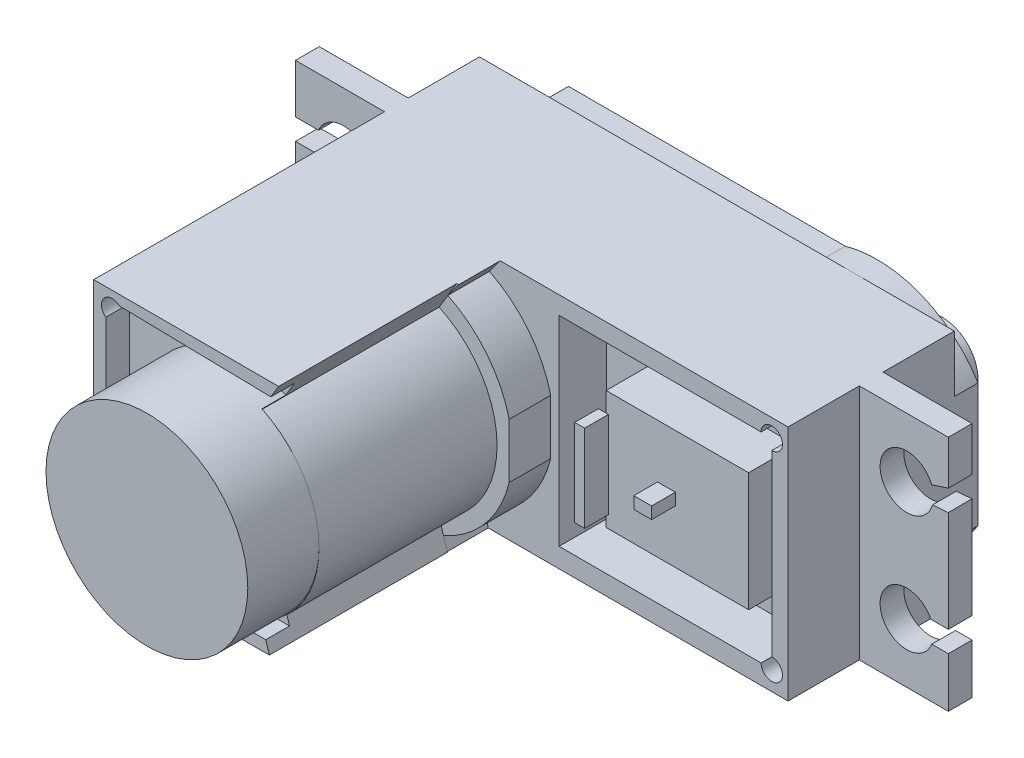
ISO-10303-21;
HEADER;
FILE_DESCRIPTION(('STEP AP214'),'2;1');
FILE_NAME('part.step','',(''),(''),'','','');
FILE_SCHEMA(('AUTOMOTIVE_DESIGN { 1 0 10303 214 1 1 1 1 }'));
ENDSEC;
DATA;
#1=APPLICATION_CONTEXT('core data for automotive mechanical design processes');
#2=APPLICATION_PROTOCOL_DEFINITION('international standard','automotive_design',2000,#1);
#3=PRODUCT_CONTEXT('',#1,'mechanical');
#4=PRODUCT('Part','Part','',(#3));
#5=PRODUCT_RELATED_PRODUCT_CATEGORY('part','',(#4));
#6=PRODUCT_DEFINITION_FORMATION('','',#4);
#7=PRODUCT_DEFINITION_CONTEXT('part definition',#1,'design');
#8=PRODUCT_DEFINITION('design','',#6,#7);
#9=PRODUCT_DEFINITION_SHAPE('','',#8);
#10=(LENGTH_UNIT() NAMED_UNIT(*) SI_UNIT(.MILLI.,.METRE.));
#11=(NAMED_UNIT(*) PLANE_ANGLE_UNIT() SI_UNIT($,.RADIAN.));
#12=(NAMED_UNIT(*) SI_UNIT($,.STERADIAN.) SOLID_ANGLE_UNIT());
#13=UNCERTAINTY_MEASURE_WITH_UNIT(LENGTH_MEASURE(1.E-05),#10,'distance_accuracy_value','');
#14=(GEOMETRIC_REPRESENTATION_CONTEXT(3) GLOBAL_UNCERTAINTY_ASSIGNED_CONTEXT((#13)) GLOBAL_UNIT_ASSIGNED_CONTEXT((#10,
#11,#12)) REPRESENTATION_CONTEXT('',''));
#15=CARTESIAN_POINT('',(0.,0.,0.));
#16=DIRECTION('',(0.,0.,1.));
#17=DIRECTION('',(1.,0.,0.));
#18=AXIS2_PLACEMENT_3D('',#15,#16,#17);
#19=CARTESIAN_POINT('',(0.,0.,20.8865546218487));
#20=DIRECTION('',(0.,0.,1.));
#21=DIRECTION('',(1.,0.,0.));
#22=AXIS2_PLACEMENT_3D('',#19,#20,#21);
#23=PLANE('',#22);
#24=DIRECTION('',(-0.618160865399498,0.786051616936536,0.));
#25=VECTOR('',#24,1.);
#26=CARTESIAN_POINT('',(6.31511898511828,0.977080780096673,20.8865546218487));
#27=LINE('',#26,#25);
#28=CARTESIAN_POINT('',(4.51332202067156,3.26824072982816,20.8865546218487));
#29=VERTEX_POINT('',#28);
#30=CARTESIAN_POINT('',(4.47374932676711,3.31856125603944,20.8865546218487));
#31=VERTEX_POINT('',#30);
#32=EDGE_CURVE('E558',#29,#31,#27,.T.);
#33=ORIENTED_EDGE('',*,*,#32,.F.);
#34=CARTESIAN_POINT('',(-0.721486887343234,9.89070166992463,20.8865546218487));
#35=DIRECTION('',(0.,0.,-1.));
#36=DIRECTION('',(1.,0.,0.));
#37=AXIS2_PLACEMENT_3D('',#34,#35,#36);
#38=CIRCLE('',#37,8.44157646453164);
#39=CARTESIAN_POINT('',(7.71938197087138,9.99999999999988,20.8865546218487));
#40=VERTEX_POINT('',#39);
#41=EDGE_CURVE('E632',#40,#29,#38,.T.);
#42=ORIENTED_EDGE('',*,*,#41,.F.);
#43=CARTESIAN_POINT('',(-0.78061802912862,10.,20.8865546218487));
#44=DIRECTION('',(0.,0.,1.));
#45=DIRECTION('',(1.,0.,0.));
#46=AXIS2_PLACEMENT_3D('',#43,#44,#45);
#47=CIRCLE('',#46,8.5);
#48=EDGE_CURVE('E651',#31,#40,#47,.T.);
#49=ORIENTED_EDGE('',*,*,#48,.F.);
#50=EDGE_LOOP('',(#33,#42,#49));
#51=FACE_BOUND('',#50,.T.);
#52=ADVANCED_FACE('F63',(#51),#23,.T.);
#53=CARTESIAN_POINT('',(0.,0.,0.));
#54=DIRECTION('',(0.,1.,0.));
#55=DIRECTION('',(0.,0.,1.));
#56=AXIS2_PLACEMENT_3D('',#53,#54,#55);
#57=PLANE('',#56);
#58=DIRECTION('',(1.,0.,0.));
#59=VECTOR('',#58,1.);
#60=CARTESIAN_POINT('',(8.73949579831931,0.,2.38655462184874));
#61=LINE('',#60,#59);
#62=CARTESIAN_POINT('',(3.47943379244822,0.,2.38655462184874));
#63=VERTEX_POINT('',#62);
#64=CARTESIAN_POINT('',(28.7394957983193,0.,2.38655462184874));
#65=VERTEX_POINT('',#64);
#66=EDGE_CURVE('E789',#63,#65,#61,.T.);
#67=ORIENTED_EDGE('',*,*,#66,.F.);
#68=DIRECTION('',(0.,0.,1.));
#69=VECTOR('',#68,1.);
#70=CARTESIAN_POINT('',(3.47943379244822,0.,0.));
#71=LINE('',#70,#69);
#72=CARTESIAN_POINT('',(3.47943379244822,0.,5.88655462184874));
#73=VERTEX_POINT('',#72);
#74=EDGE_CURVE('E1075',#63,#73,#71,.T.);
#75=ORIENTED_EDGE('',*,*,#74,.T.);
#76=DIRECTION('',(1.,0.,0.));
#77=VECTOR('',#76,1.);
#78=CARTESIAN_POINT('',(0.,0.,5.88655462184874));
#79=LINE('',#78,#77);
#80=CARTESIAN_POINT('',(3.53463266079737,0.,5.88655462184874));
#81=VERTEX_POINT('',#80);
#82=EDGE_CURVE('E610',#73,#81,#79,.T.);
#83=ORIENTED_EDGE('',*,*,#82,.T.);
#84=DIRECTION('',(0.,0.,1.));
#85=VECTOR('',#84,1.);
#86=CARTESIAN_POINT('',(3.53463266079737,0.,0.));
#87=LINE('',#86,#85);
#88=CARTESIAN_POINT('',(3.53463266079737,0.,20.8865546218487));
#89=VERTEX_POINT('',#88);
#90=EDGE_CURVE('E641',#81,#89,#87,.T.);
#91=ORIENTED_EDGE('',*,*,#90,.T.);
#92=DIRECTION('',(1.,0.,0.));
#93=VECTOR('',#92,1.);
#94=CARTESIAN_POINT('',(0.,0.,20.8865546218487));
#95=LINE('',#94,#93);
#96=CARTESIAN_POINT('',(-11.2605042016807,0.,20.8865546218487));
#97=VERTEX_POINT('',#96);
#98=EDGE_CURVE('E650',#97,#89,#95,.T.);
#99=ORIENTED_EDGE('',*,*,#98,.F.);
#100=DIRECTION('',(0.,0.,1.));
#101=VECTOR('',#100,1.);
#102=CARTESIAN_POINT('',(-11.2605042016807,0.,-3.61344537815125));
#103=LINE('',#102,#101);
#104=CARTESIAN_POINT('',(-11.2605042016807,0.,-3.61344537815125));
#105=VERTEX_POINT('',#104);
#106=EDGE_CURVE('E990',#105,#97,#103,.T.);
#107=ORIENTED_EDGE('',*,*,#106,.F.);
#108=DIRECTION('',(1.,0.,0.));
#109=VECTOR('',#108,1.);
#110=CARTESIAN_POINT('',(-11.2605042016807,0.,-3.61344537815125));
#111=LINE('',#110,#109);
#112=CARTESIAN_POINT('',(-18.7605042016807,0.,-3.61344537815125));
#113=VERTEX_POINT('',#112);
#114=EDGE_CURVE('E988',#113,#105,#111,.T.);
#115=ORIENTED_EDGE('',*,*,#114,.F.);
#116=DIRECTION('',(0.,0.,1.));
#117=VECTOR('',#116,1.);
#118=CARTESIAN_POINT('',(-18.7605042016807,0.,-3.61344537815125));
#119=LINE('',#118,#117);
#120=CARTESIAN_POINT('',(-18.7605042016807,0.,-5.61344537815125));
#121=VERTEX_POINT('',#120);
#122=EDGE_CURVE('E985',#121,#113,#119,.T.);
#123=ORIENTED_EDGE('',*,*,#122,.F.);
#124=DIRECTION('',(-1.,0.,0.));
#125=VECTOR('',#124,1.);
#126=CARTESIAN_POINT('',(-18.7605042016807,0.,-5.61344537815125));
#127=LINE('',#126,#125);
#128=CARTESIAN_POINT('',(-11.2605042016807,0.,-5.61344537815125));
#129=VERTEX_POINT('',#128);
#130=EDGE_CURVE('E982',#129,#121,#127,.T.);
#131=ORIENTED_EDGE('',*,*,#130,.F.);
#132=DIRECTION('',(0.,0.,1.));
#133=VECTOR('',#132,1.);
#134=CARTESIAN_POINT('',(-11.2605042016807,0.,-13.6134453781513));
#135=LINE('',#134,#133);
#136=CARTESIAN_POINT('',(-11.2605042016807,0.,-11.6134453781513));
#137=VERTEX_POINT('',#136);
#138=EDGE_CURVE('E956',#137,#129,#135,.T.);
#139=ORIENTED_EDGE('',*,*,#138,.F.);
#140=DIRECTION('',(1.,0.,0.));
#141=VECTOR('',#140,1.);
#142=CARTESIAN_POINT('',(0.,0.,-11.6134453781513));
#143=LINE('',#142,#141);
#144=CARTESIAN_POINT('',(28.7394957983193,0.,-11.6134453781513));
#145=VERTEX_POINT('',#144);
#146=EDGE_CURVE('E952',#137,#145,#143,.T.);
#147=ORIENTED_EDGE('',*,*,#146,.T.);
#148=DIRECTION('',(0.,0.,-1.));
#149=VECTOR('',#148,1.);
#150=CARTESIAN_POINT('',(28.7394957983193,0.,-13.6134453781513));
#151=LINE('',#150,#149);
#152=CARTESIAN_POINT('',(28.7394957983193,0.,-5.61344537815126));
#153=VERTEX_POINT('',#152);
#154=EDGE_CURVE('E960',#153,#145,#151,.T.);
#155=ORIENTED_EDGE('',*,*,#154,.F.);
#156=DIRECTION('',(-1.,0.,0.));
#157=VECTOR('',#156,1.);
#158=CARTESIAN_POINT('',(36.2394957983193,0.,-5.61344537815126));
#159=LINE('',#158,#157);
#160=CARTESIAN_POINT('',(36.2394957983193,0.,-5.61344537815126));
#161=VERTEX_POINT('',#160);
#162=EDGE_CURVE('E1001',#161,#153,#159,.T.);
#163=ORIENTED_EDGE('',*,*,#162,.F.);
#164=DIRECTION('',(0.,0.,-1.));
#165=VECTOR('',#164,1.);
#166=CARTESIAN_POINT('',(36.2394957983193,0.,-3.61344537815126));
#167=LINE('',#166,#165);
#168=CARTESIAN_POINT('',(36.2394957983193,0.,-3.61344537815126));
#169=VERTEX_POINT('',#168);
#170=EDGE_CURVE('E998',#169,#161,#167,.T.);
#171=ORIENTED_EDGE('',*,*,#170,.F.);
#172=DIRECTION('',(1.,0.,0.));
#173=VECTOR('',#172,1.);
#174=CARTESIAN_POINT('',(28.7394957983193,0.,-3.61344537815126));
#175=LINE('',#174,#173);
#176=CARTESIAN_POINT('',(28.7394957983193,0.,-3.61344537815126));
#177=VERTEX_POINT('',#176);
#178=EDGE_CURVE('E995',#177,#169,#175,.T.);
#179=ORIENTED_EDGE('',*,*,#178,.F.);
#180=DIRECTION('',(0.,0.,-1.));
#181=VECTOR('',#180,1.);
#182=CARTESIAN_POINT('',(28.7394957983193,0.,-3.61344537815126));
#183=LINE('',#182,#181);
#184=EDGE_CURVE('E993',#65,#177,#183,.T.);
#185=ORIENTED_EDGE('',*,*,#184,.F.);
#186=EDGE_LOOP('',(#67,#75,#83,#91,#99,#107,#115,#123,#131,#139,#147,#155,#163,#171,#179,#185));
#187=FACE_BOUND('',#186,.T.);
#188=ADVANCED_FACE('F1176',(#187),#57,.F.);
#189=CARTESIAN_POINT('',(-0.721486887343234,9.89070166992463,5.88655462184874));
#190=DIRECTION('',(0.,0.,1.));
#191=DIRECTION('',(1.,0.,0.));
#192=AXIS2_PLACEMENT_3D('',#189,#190,#191);
#193=PLANE('',#192);
#194=CARTESIAN_POINT('',(-0.78061802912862,10.,5.88655462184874));
#195=DIRECTION('',(0.,0.,1.));
#196=DIRECTION('',(1.,0.,0.));
#197=AXIS2_PLACEMENT_3D('',#194,#195,#196);
#198=CIRCLE('',#197,9.79623840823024);
#199=CARTESIAN_POINT('',(8.73949579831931,7.69051528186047,5.88655462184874));
#200=VERTEX_POINT('',#199);
#201=CARTESIAN_POINT('',(3.2087671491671,1.05287236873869,5.88655462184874));
#202=VERTEX_POINT('',#201);
#203=EDGE_CURVE('E1072',#200,#202,#198,.F.);
#204=ORIENTED_EDGE('',*,*,#203,.F.);
#205=DIRECTION('',(0.,1.,0.));
#206=VECTOR('',#205,1.);
#207=CARTESIAN_POINT('',(8.73949579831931,22.,5.88655462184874));
#208=LINE('',#207,#206);
#209=CARTESIAN_POINT('',(8.73949579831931,12.3094847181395,5.88655462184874));
#210=VERTEX_POINT('',#209);
#211=EDGE_CURVE('E1067',#200,#210,#208,.T.);
#212=ORIENTED_EDGE('',*,*,#211,.T.);
#213=CARTESIAN_POINT('',(-0.78061802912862,10.,5.88655462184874));
#214=DIRECTION('',(0.,0.,-1.));
#215=DIRECTION('',(1.,0.,0.));
#216=AXIS2_PLACEMENT_3D('',#213,#214,#215);
#217=CIRCLE('',#216,9.79623840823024);
#218=CARTESIAN_POINT('',(3.58108579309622,18.7716490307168,5.88655462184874));
#219=VERTEX_POINT('',#218);
#220=EDGE_CURVE('E592',#219,#210,#217,.T.);
#221=ORIENTED_EDGE('',*,*,#220,.F.);
#222=DIRECTION('',(-0.515592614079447,-0.856833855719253,0.));
#223=VECTOR('',#222,1.);
#224=CARTESIAN_POINT('',(6.66990583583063,23.9047822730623,5.88655462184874));
#225=LINE('',#224,#223);
#226=CARTESIAN_POINT('',(2.84193585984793,17.5432980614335,5.88655462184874));
#227=VERTEX_POINT('',#226);
#228=EDGE_CURVE('E618',#219,#227,#225,.T.);
#229=ORIENTED_EDGE('',*,*,#228,.T.);
#230=CARTESIAN_POINT('',(-0.721486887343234,9.89070166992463,5.88655462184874));
#231=DIRECTION('',(0.,0.,-1.));
#232=DIRECTION('',(1.,0.,0.));
#233=AXIS2_PLACEMENT_3D('',#230,#231,#232);
#234=CIRCLE('',#233,8.44157646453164);
#235=CARTESIAN_POINT('',(2.84193585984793,2.23810527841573,5.88655462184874));
#236=VERTEX_POINT('',#235);
#237=EDGE_CURVE('E617',#227,#236,#234,.T.);
#238=ORIENTED_EDGE('',*,*,#237,.T.);
#239=DIRECTION('',(0.295664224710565,-0.955291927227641,0.));
#240=VECTOR('',#239,1.);
#241=CARTESIAN_POINT('',(4.75592084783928,-3.94598550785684,5.88655462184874));
#242=LINE('',#241,#240);
#243=EDGE_CURVE('E622',#236,#202,#242,.T.);
#244=ORIENTED_EDGE('',*,*,#243,.T.);
#245=EDGE_LOOP('',(#204,#212,#221,#229,#238,#244));
#246=FACE_BOUND('',#245,.T.);
#247=ADVANCED_FACE('F1173',(#246),#193,.T.);
#248=CARTESIAN_POINT('',(8.73949579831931,22.,31.7024611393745));
#249=DIRECTION('',(-1.,0.,0.));
#250=DIRECTION('',(0.,0.,1.));
#251=AXIS2_PLACEMENT_3D('',#248,#249,#250);
#252=PLANE('',#251);
#253=ORIENTED_EDGE('',*,*,#211,.F.);
#254=DIRECTION('',(0.,0.,1.));
#255=VECTOR('',#254,1.);
#256=CARTESIAN_POINT('',(8.73949579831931,7.69051528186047,2.38655462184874));
#257=LINE('',#256,#255);
#258=CARTESIAN_POINT('',(8.73949579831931,7.69051528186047,2.38655462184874));
#259=VERTEX_POINT('',#258);
#260=EDGE_CURVE('E607',#200,#259,#257,.F.);
#261=ORIENTED_EDGE('',*,*,#260,.T.);
#262=DIRECTION('',(0.,-1.,0.));
#263=VECTOR('',#262,1.);
#264=CARTESIAN_POINT('',(8.73949579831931,22.,2.38655462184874));
#265=LINE('',#264,#263);
#266=CARTESIAN_POINT('',(8.73949579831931,12.3094847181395,2.38655462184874));
#267=VERTEX_POINT('',#266);
#268=EDGE_CURVE('E793',#267,#259,#265,.T.);
#269=ORIENTED_EDGE('',*,*,#268,.F.);
#270=DIRECTION('',(0.,0.,1.));
#271=VECTOR('',#270,1.);
#272=CARTESIAN_POINT('',(8.73949579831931,12.3094847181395,2.38655462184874));
#273=LINE('',#272,#271);
#274=EDGE_CURVE('E604',#267,#210,#273,.T.);
#275=ORIENTED_EDGE('',*,*,#274,.T.);
#276=EDGE_LOOP('',(#253,#261,#269,#275));
#277=FACE_BOUND('',#276,.T.);
#278=ADVANCED_FACE('F1273',(#277),#252,.F.);
#279=CARTESIAN_POINT('',(-11.2605042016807,20.,-3.61344537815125));
#280=DIRECTION('',(1.,0.,0.));
#281=DIRECTION('',(0.,0.,-1.));
#282=AXIS2_PLACEMENT_3D('',#279,#280,#281);
#283=PLANE('',#282);
#284=DIRECTION('',(0.,-1.,0.));
#285=VECTOR('',#284,1.);
#286=CARTESIAN_POINT('',(-11.2605042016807,20.,20.8865546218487));
#287=LINE('',#286,#285);
#288=CARTESIAN_POINT('',(-11.2605042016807,20.,20.8865546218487));
#289=VERTEX_POINT('',#288);
#290=EDGE_CURVE('E659',#289,#97,#287,.T.);
#291=ORIENTED_EDGE('',*,*,#290,.F.);
#292=DIRECTION('',(0.,0.,1.));
#293=VECTOR('',#292,1.);
#294=CARTESIAN_POINT('',(-11.2605042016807,20.,-3.61344537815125));
#295=LINE('',#294,#293);
#296=CARTESIAN_POINT('',(-11.2605042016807,20.,-3.61344537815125));
#297=VERTEX_POINT('',#296);
#298=EDGE_CURVE('E966',#297,#289,#295,.T.);
#299=ORIENTED_EDGE('',*,*,#298,.F.);
#300=DIRECTION('',(0.,-1.,0.));
#301=VECTOR('',#300,1.);
#302=CARTESIAN_POINT('',(-11.2605042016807,20.,-3.61344537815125));
#303=LINE('',#302,#301);
#304=EDGE_CURVE('E1023',#297,#105,#303,.T.);
#305=ORIENTED_EDGE('',*,*,#304,.T.);
#306=ORIENTED_EDGE('',*,*,#106,.T.);
#307=EDGE_LOOP('',(#291,#299,#305,#306));
#308=FACE_BOUND('',#307,.T.);
#309=ADVANCED_FACE('F1276',(#308),#283,.F.);
#310=CARTESIAN_POINT('',(0.,20.,0.));
#311=DIRECTION('',(0.,1.,0.));
#312=DIRECTION('',(0.,0.,1.));
#313=AXIS2_PLACEMENT_3D('',#310,#311,#312);
#314=PLANE('',#313);
#315=DIRECTION('',(0.,0.,1.));
#316=VECTOR('',#315,1.);
#317=CARTESIAN_POINT('',(4.48308166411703,20.,0.));
#318=LINE('',#317,#316);
#319=CARTESIAN_POINT('',(4.48308166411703,20.,2.38655462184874));
#320=VERTEX_POINT('',#319);
#321=CARTESIAN_POINT('',(4.48308166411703,20.,5.88655462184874));
#322=VERTEX_POINT('',#321);
#323=EDGE_CURVE('E600',#320,#322,#318,.T.);
#324=ORIENTED_EDGE('',*,*,#323,.F.);
#325=DIRECTION('',(-1.,0.,0.));
#326=VECTOR('',#325,1.);
#327=CARTESIAN_POINT('',(0.,20.,2.38655462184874));
#328=LINE('',#327,#326);
#329=CARTESIAN_POINT('',(28.7394957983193,20.,2.38655462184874));
#330=VERTEX_POINT('',#329);
#331=EDGE_CURVE('E797',#330,#320,#328,.T.);
#332=ORIENTED_EDGE('',*,*,#331,.F.);
#333=DIRECTION('',(0.,0.,-1.));
#334=VECTOR('',#333,1.);
#335=CARTESIAN_POINT('',(28.7394957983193,20.,-3.61344537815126));
#336=LINE('',#335,#334);
#337=CARTESIAN_POINT('',(28.7394957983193,20.,-3.61344537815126));
#338=VERTEX_POINT('',#337);
#339=EDGE_CURVE('E969',#330,#338,#336,.T.);
#340=ORIENTED_EDGE('',*,*,#339,.T.);
#341=DIRECTION('',(1.,0.,0.));
#342=VECTOR('',#341,1.);
#343=CARTESIAN_POINT('',(28.7394957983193,20.,-3.61344537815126));
#344=LINE('',#343,#342);
#345=CARTESIAN_POINT('',(36.2394957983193,20.,-3.61344537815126));
#346=VERTEX_POINT('',#345);
#347=EDGE_CURVE('E971',#338,#346,#344,.T.);
#348=ORIENTED_EDGE('',*,*,#347,.T.);
#349=DIRECTION('',(0.,0.,-1.));
#350=VECTOR('',#349,1.);
#351=CARTESIAN_POINT('',(36.2394957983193,20.,-3.61344537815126));
#352=LINE('',#351,#350);
#353=CARTESIAN_POINT('',(36.2394957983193,20.,-5.61344537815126));
#354=VERTEX_POINT('',#353);
#355=EDGE_CURVE('E973',#346,#354,#352,.T.);
#356=ORIENTED_EDGE('',*,*,#355,.T.);
#357=DIRECTION('',(-1.,0.,0.));
#358=VECTOR('',#357,1.);
#359=CARTESIAN_POINT('',(36.2394957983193,20.,-5.61344537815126));
#360=LINE('',#359,#358);
#361=CARTESIAN_POINT('',(28.7394957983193,20.,-5.61344537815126));
#362=VERTEX_POINT('',#361);
#363=EDGE_CURVE('E975',#354,#362,#360,.T.);
#364=ORIENTED_EDGE('',*,*,#363,.T.);
#365=DIRECTION('',(0.,0.,-1.));
#366=VECTOR('',#365,1.);
#367=CARTESIAN_POINT('',(28.7394957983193,20.,-13.6134453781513));
#368=LINE('',#367,#366);
#369=CARTESIAN_POINT('',(28.7394957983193,20.,-11.6134453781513));
#370=VERTEX_POINT('',#369);
#371=EDGE_CURVE('E977',#362,#370,#368,.T.);
#372=ORIENTED_EDGE('',*,*,#371,.T.);
#373=DIRECTION('',(1.,0.,0.));
#374=VECTOR('',#373,1.);
#375=CARTESIAN_POINT('',(0.,20.,-11.6134453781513));
#376=LINE('',#375,#374);
#377=CARTESIAN_POINT('',(-11.2605042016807,20.,-11.6134453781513));
#378=VERTEX_POINT('',#377);
#379=EDGE_CURVE('E939',#378,#370,#376,.T.);
#380=ORIENTED_EDGE('',*,*,#379,.F.);
#381=DIRECTION('',(0.,0.,1.));
#382=VECTOR('',#381,1.);
#383=CARTESIAN_POINT('',(-11.2605042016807,20.,-13.6134453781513));
#384=LINE('',#383,#382);
#385=CARTESIAN_POINT('',(-11.2605042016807,20.,-5.61344537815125));
#386=VERTEX_POINT('',#385);
#387=EDGE_CURVE('E957',#378,#386,#384,.T.);
#388=ORIENTED_EDGE('',*,*,#387,.T.);
#389=DIRECTION('',(-1.,0.,0.));
#390=VECTOR('',#389,1.);
#391=CARTESIAN_POINT('',(-18.7605042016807,20.,-5.61344537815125));
#392=LINE('',#391,#390);
#393=CARTESIAN_POINT('',(-18.7605042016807,20.,-5.61344537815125));
#394=VERTEX_POINT('',#393);
#395=EDGE_CURVE('E959',#386,#394,#392,.T.);
#396=ORIENTED_EDGE('',*,*,#395,.T.);
#397=DIRECTION('',(0.,0.,1.));
#398=VECTOR('',#397,1.);
#399=CARTESIAN_POINT('',(-18.7605042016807,20.,-3.61344537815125));
#400=LINE('',#399,#398);
#401=CARTESIAN_POINT('',(-18.7605042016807,20.,-3.61344537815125));
#402=VERTEX_POINT('',#401);
#403=EDGE_CURVE('E962',#394,#402,#400,.T.);
#404=ORIENTED_EDGE('',*,*,#403,.T.);
#405=DIRECTION('',(1.,0.,0.));
#406=VECTOR('',#405,1.);
#407=CARTESIAN_POINT('',(-11.2605042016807,20.,-3.61344537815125));
#408=LINE('',#407,#406);
#409=EDGE_CURVE('E964',#402,#297,#408,.T.);
#410=ORIENTED_EDGE('',*,*,#409,.T.);
#411=ORIENTED_EDGE('',*,*,#298,.T.);
#412=DIRECTION('',(1.,0.,0.));
#413=VECTOR('',#412,1.);
#414=CARTESIAN_POINT('',(0.,20.,20.8865546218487));
#415=LINE('',#414,#413);
#416=CARTESIAN_POINT('',(4.32023572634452,20.,20.8865546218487));
#417=VERTEX_POINT('',#416);
#418=EDGE_CURVE('E656',#289,#417,#415,.T.);
#419=ORIENTED_EDGE('',*,*,#418,.T.);
#420=DIRECTION('',(0.,0.,1.));
#421=VECTOR('',#420,1.);
#422=CARTESIAN_POINT('',(4.32023572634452,20.,0.));
#423=LINE('',#422,#421);
#424=CARTESIAN_POINT('',(4.32023572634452,20.,5.88655462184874));
#425=VERTEX_POINT('',#424);
#426=EDGE_CURVE('E637',#425,#417,#423,.T.);
#427=ORIENTED_EDGE('',*,*,#426,.F.);
#428=DIRECTION('',(1.,0.,0.));
#429=VECTOR('',#428,1.);
#430=CARTESIAN_POINT('',(0.,20.,5.88655462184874));
#431=LINE('',#430,#429);
#432=EDGE_CURVE('E644',#425,#322,#431,.T.);
#433=ORIENTED_EDGE('',*,*,#432,.T.);
#434=EDGE_LOOP('',(#324,#332,#340,#348,#356,#364,#372,#380,#388,#396,#404,#410,#411,#419,#427,#433));
#435=FACE_BOUND('',#434,.T.);
#436=ADVANCED_FACE('F1371',(#435),#314,.T.);
#437=CARTESIAN_POINT('',(8.73949579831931,22.,2.38655462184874));
#438=DIRECTION('',(0.,0.,-1.));
#439=DIRECTION('',(-1.,0.,0.));
#440=AXIS2_PLACEMENT_3D('',#437,#438,#439);
#441=PLANE('',#440);
#442=DIRECTION('',(0.,-1.,0.));
#443=VECTOR('',#442,1.);
#444=CARTESIAN_POINT('',(17.7394957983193,10.4884232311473,2.38655462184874));
#445=LINE('',#444,#443);
#446=CARTESIAN_POINT('',(17.7394957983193,10.4884232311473,2.38655462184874));
#447=VERTEX_POINT('',#446);
#448=CARTESIAN_POINT('',(17.7394957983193,9.48842323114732,2.38655462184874));
#449=VERTEX_POINT('',#448);
#450=EDGE_CURVE('E695',#447,#449,#445,.T.);
#451=ORIENTED_EDGE('',*,*,#450,.F.);
#452=DIRECTION('',(-1.,0.,0.));
#453=VECTOR('',#452,1.);
#454=CARTESIAN_POINT('',(17.7394957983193,10.4884232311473,2.38655462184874));
#455=LINE('',#454,#453);
#456=CARTESIAN_POINT('',(19.2394957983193,10.4884232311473,2.38655462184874));
#457=VERTEX_POINT('',#456);
#458=EDGE_CURVE('E700',#457,#447,#455,.T.);
#459=ORIENTED_EDGE('',*,*,#458,.F.);
#460=DIRECTION('',(0.,1.,0.));
#461=VECTOR('',#460,1.);
#462=CARTESIAN_POINT('',(19.2394957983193,10.4884232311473,2.38655462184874));
#463=LINE('',#462,#461);
#464=CARTESIAN_POINT('',(19.2394957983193,9.48842323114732,2.38655462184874));
#465=VERTEX_POINT('',#464);
#466=EDGE_CURVE('E712',#465,#457,#463,.T.);
#467=ORIENTED_EDGE('',*,*,#466,.F.);
#468=DIRECTION('',(1.,0.,0.));
#469=VECTOR('',#468,1.);
#470=CARTESIAN_POINT('',(17.7394957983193,9.48842323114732,2.38655462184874));
#471=LINE('',#470,#469);
#472=EDGE_CURVE('E709',#449,#465,#471,.T.);
#473=ORIENTED_EDGE('',*,*,#472,.F.);
#474=EDGE_LOOP('',(#451,#459,#467,#473));
#475=FACE_BOUND('',#474,.T.);
#476=DIRECTION('',(-1.,0.,0.));
#477=VECTOR('',#476,1.);
#478=CARTESIAN_POINT('',(13.6019388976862,13.3463759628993,2.38655462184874));
#479=LINE('',#478,#477);
#480=CARTESIAN_POINT('',(13.6019388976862,13.3463759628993,2.38655462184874));
#481=VERTEX_POINT('',#480);
#482=CARTESIAN_POINT('',(13.4144777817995,13.3463759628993,2.38655462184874));
#483=VERTEX_POINT('',#482);
#484=EDGE_CURVE('E676',#481,#483,#479,.T.);
#485=ORIENTED_EDGE('',*,*,#484,.F.);
#486=DIRECTION('',(0.,1.,0.));
#487=VECTOR('',#486,1.);
#488=CARTESIAN_POINT('',(13.6019388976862,13.3463759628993,2.38655462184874));
#489=LINE('',#488,#487);
#490=CARTESIAN_POINT('',(13.6019388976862,6.02992691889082,2.38655462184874));
#491=VERTEX_POINT('',#490);
#492=EDGE_CURVE('E661',#491,#481,#489,.T.);
#493=ORIENTED_EDGE('',*,*,#492,.F.);
#494=DIRECTION('',(1.,0.,0.));
#495=VECTOR('',#494,1.);
#496=CARTESIAN_POINT('',(13.6019388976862,6.02992691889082,2.38655462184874));
#497=LINE('',#496,#495);
#498=CARTESIAN_POINT('',(13.4144777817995,6.02992691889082,2.38655462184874));
#499=VERTEX_POINT('',#498);
#500=EDGE_CURVE('E681',#499,#491,#497,.T.);
#501=ORIENTED_EDGE('',*,*,#500,.F.);
#502=DIRECTION('',(0.,-1.,0.));
#503=VECTOR('',#502,1.);
#504=CARTESIAN_POINT('',(13.4144777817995,15.,2.38655462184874));
#505=LINE('',#504,#503);
#506=CARTESIAN_POINT('',(13.4144777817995,5.,2.38655462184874));
#507=VERTEX_POINT('',#506);
#508=EDGE_CURVE('E728',#499,#507,#505,.T.);
#509=ORIENTED_EDGE('',*,*,#508,.T.);
#510=DIRECTION('',(1.,0.,0.));
#511=VECTOR('',#510,1.);
#512=CARTESIAN_POINT('',(13.4144777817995,5.,2.38655462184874));
#513=LINE('',#512,#511);
#514=CARTESIAN_POINT('',(25.4144777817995,5.,2.38655462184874));
#515=VERTEX_POINT('',#514);
#516=EDGE_CURVE('E746',#507,#515,#513,.T.);
#517=ORIENTED_EDGE('',*,*,#516,.T.);
#518=DIRECTION('',(0.,1.,0.));
#519=VECTOR('',#518,1.);
#520=CARTESIAN_POINT('',(25.4144777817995,15.,2.38655462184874));
#521=LINE('',#520,#519);
#522=CARTESIAN_POINT('',(25.4144777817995,15.,2.38655462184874));
#523=VERTEX_POINT('',#522);
#524=EDGE_CURVE('E750',#515,#523,#521,.T.);
#525=ORIENTED_EDGE('',*,*,#524,.T.);
#526=DIRECTION('',(-1.,0.,0.));
#527=VECTOR('',#526,1.);
#528=CARTESIAN_POINT('',(13.4144777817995,15.,2.38655462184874));
#529=LINE('',#528,#527);
#530=CARTESIAN_POINT('',(13.4144777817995,15.,2.38655462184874));
#531=VERTEX_POINT('',#530);
#532=EDGE_CURVE('E733',#523,#531,#529,.T.);
#533=ORIENTED_EDGE('',*,*,#532,.T.);
#534=EDGE_CURVE('E743',#531,#483,#505,.T.);
#535=ORIENTED_EDGE('',*,*,#534,.T.);
#536=EDGE_LOOP('',(#485,#493,#501,#509,#517,#525,#533,#535));
#537=FACE_BOUND('',#536,.T.);
#538=ADVANCED_FACE('F1272',(#475,#537),#441,.F.);
#539=CARTESIAN_POINT('',(-18.7605042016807,20.,-3.61344537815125));
#540=DIRECTION('',(1.,0.,0.));
#541=DIRECTION('',(0.,0.,-1.));
#542=AXIS2_PLACEMENT_3D('',#539,#540,#541);
#543=PLANE('',#542);
#544=DIRECTION('',(0.,-1.,0.));
#545=VECTOR('',#544,1.);
#546=CARTESIAN_POINT('',(-18.7605042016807,20.,-5.61344537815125));
#547=LINE('',#546,#545);
#548=CARTESIAN_POINT('',(-18.7605042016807,14.0868198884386,-5.61344537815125));
#549=VERTEX_POINT('',#548);
#550=CARTESIAN_POINT('',(-18.7605042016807,5.91084852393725,-5.61344537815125));
#551=VERTEX_POINT('',#550);
#552=EDGE_CURVE('E1036',#549,#551,#547,.T.);
#553=ORIENTED_EDGE('',*,*,#552,.T.);
#554=DIRECTION('',(0.,0.,1.));
#555=VECTOR('',#554,1.);
#556=CARTESIAN_POINT('',(-18.7605042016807,5.91084852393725,-3.61344537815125));
#557=LINE('',#556,#555);
#558=CARTESIAN_POINT('',(-18.7605042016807,5.91084852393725,-3.61344537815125));
#559=VERTEX_POINT('',#558);
#560=EDGE_CURVE('E882',#551,#559,#557,.T.);
#561=ORIENTED_EDGE('',*,*,#560,.T.);
#562=DIRECTION('',(0.,-1.,0.));
#563=VECTOR('',#562,1.);
#564=CARTESIAN_POINT('',(-18.7605042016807,20.,-3.61344537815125));
#565=LINE('',#564,#563);
#566=CARTESIAN_POINT('',(-18.7605042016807,14.0868198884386,-3.61344537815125));
#567=VERTEX_POINT('',#566);
#568=EDGE_CURVE('E1031',#567,#559,#565,.T.);
#569=ORIENTED_EDGE('',*,*,#568,.F.);
#570=DIRECTION('',(0.,0.,-1.));
#571=VECTOR('',#570,1.);
#572=CARTESIAN_POINT('',(-18.7605042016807,14.0868198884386,-3.61344537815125));
#573=LINE('',#572,#571);
#574=EDGE_CURVE('E873',#567,#549,#573,.T.);
#575=ORIENTED_EDGE('',*,*,#574,.T.);
#576=EDGE_LOOP('',(#553,#561,#569,#575));
#577=FACE_BOUND('',#576,.T.);
#578=ADVANCED_FACE('F1415',(#577),#543,.F.);
#579=CARTESIAN_POINT('',(-18.7605042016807,15.8709532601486,-5.61344537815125));
#580=VERTEX_POINT('',#579);
#581=EDGE_CURVE('E1032',#394,#580,#547,.T.);
#582=ORIENTED_EDGE('',*,*,#581,.T.);
#583=DIRECTION('',(0.,0.,1.));
#584=VECTOR('',#583,1.);
#585=CARTESIAN_POINT('',(-18.7605042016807,15.8709532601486,-3.61344537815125));
#586=LINE('',#585,#584);
#587=CARTESIAN_POINT('',(-18.7605042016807,15.8709532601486,-3.61344537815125));
#588=VERTEX_POINT('',#587);
#589=EDGE_CURVE('E876',#580,#588,#586,.T.);
#590=ORIENTED_EDGE('',*,*,#589,.T.);
#591=EDGE_CURVE('E1027',#402,#588,#565,.T.);
#592=ORIENTED_EDGE('',*,*,#591,.F.);
#593=ORIENTED_EDGE('',*,*,#403,.F.);
#594=EDGE_LOOP('',(#582,#590,#592,#593));
#595=FACE_BOUND('',#594,.T.);
#596=ADVANCED_FACE('F1416',(#595),#543,.F.);
#597=CARTESIAN_POINT('',(36.2394957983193,20.,-3.61344537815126));
#598=DIRECTION('',(-1.,0.,0.));
#599=DIRECTION('',(0.,0.,1.));
#600=AXIS2_PLACEMENT_3D('',#597,#598,#599);
#601=PLANE('',#600);
#602=DIRECTION('',(0.,-1.,0.));
#603=VECTOR('',#602,1.);
#604=CARTESIAN_POINT('',(36.2394957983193,20.,-5.61344537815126));
#605=LINE('',#604,#603);
#606=CARTESIAN_POINT('',(36.2394957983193,4.20619357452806,-5.61344537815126));
#607=VERTEX_POINT('',#606);
#608=EDGE_CURVE('E1010',#607,#161,#605,.T.);
#609=ORIENTED_EDGE('',*,*,#608,.F.);
#610=DIRECTION('',(0.,0.,1.));
#611=VECTOR('',#610,1.);
#612=CARTESIAN_POINT('',(36.2394957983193,4.20619357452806,-3.61344537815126));
#613=LINE('',#612,#611);
#614=CARTESIAN_POINT('',(36.2394957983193,4.20619357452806,-3.61344537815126));
#615=VERTEX_POINT('',#614);
#616=EDGE_CURVE('E864',#607,#615,#613,.T.);
#617=ORIENTED_EDGE('',*,*,#616,.T.);
#618=DIRECTION('',(0.,-1.,0.));
#619=VECTOR('',#618,1.);
#620=CARTESIAN_POINT('',(36.2394957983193,20.,-3.61344537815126));
#621=LINE('',#620,#619);
#622=EDGE_CURVE('E1014',#615,#169,#621,.T.);
#623=ORIENTED_EDGE('',*,*,#622,.T.);
#624=ORIENTED_EDGE('',*,*,#170,.T.);
#625=EDGE_LOOP('',(#609,#617,#623,#624));
#626=FACE_BOUND('',#625,.T.);
#627=ADVANCED_FACE('F1392',(#626),#601,.F.);
#628=CARTESIAN_POINT('',(36.2394957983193,16.2860978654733,-3.61344537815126));
#629=VERTEX_POINT('',#628);
#630=EDGE_CURVE('E1016',#346,#629,#621,.T.);
#631=ORIENTED_EDGE('',*,*,#630,.T.);
#632=DIRECTION('',(0.,0.,-1.));
#633=VECTOR('',#632,1.);
#634=CARTESIAN_POINT('',(36.2394957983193,16.2860978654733,-3.61344537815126));
#635=LINE('',#634,#633);
#636=CARTESIAN_POINT('',(36.2394957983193,16.2860978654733,-5.61344537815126));
#637=VERTEX_POINT('',#636);
#638=EDGE_CURVE('E852',#629,#637,#635,.T.);
#639=ORIENTED_EDGE('',*,*,#638,.T.);
#640=EDGE_CURVE('E1011',#354,#637,#605,.T.);
#641=ORIENTED_EDGE('',*,*,#640,.F.);
#642=ORIENTED_EDGE('',*,*,#355,.F.);
#643=EDGE_LOOP('',(#631,#639,#641,#642));
#644=FACE_BOUND('',#643,.T.);
#645=ADVANCED_FACE('F1378',(#644),#601,.F.);
#646=CARTESIAN_POINT('',(-11.2605042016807,20.,-13.6134453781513));
#647=DIRECTION('',(0.,0.,1.));
#648=DIRECTION('',(1.,0.,0.));
#649=AXIS2_PLACEMENT_3D('',#646,#647,#648);
#650=PLANE('',#649);
#651=CARTESIAN_POINT('',(20.2394957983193,10.,-13.6134453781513));
#652=DIRECTION('',(0.,0.,1.));
#653=DIRECTION('',(1.,0.,0.));
#654=AXIS2_PLACEMENT_3D('',#651,#652,#653);
#655=CIRCLE('',#654,6.52321291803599);
#656=CARTESIAN_POINT('',(26.7627087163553,10.,-13.6134453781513));
#657=VERTEX_POINT('',#656);
#658=EDGE_CURVE('E953',#657,#657,#655,.F.);
#659=ORIENTED_EDGE('',*,*,#658,.F.);
#660=EDGE_LOOP('',(#659));
#661=FACE_BOUND('',#660,.T.);
#662=CARTESIAN_POINT('',(20.2394957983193,10.,-13.6134453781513));
#663=DIRECTION('',(0.,0.,-1.));
#664=DIRECTION('',(-1.,0.,0.));
#665=AXIS2_PLACEMENT_3D('',#662,#663,#664);
#666=CIRCLE('',#665,9.97077663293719);
#667=CARTESIAN_POINT('',(28.7394957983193,4.78786160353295,-13.6134453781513));
#668=VERTEX_POINT('',#667);
#669=CARTESIAN_POINT('',(17.5500359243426,0.398792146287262,-13.6134453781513));
#670=VERTEX_POINT('',#669);
#671=EDGE_CURVE('E918',#668,#670,#666,.T.);
#672=ORIENTED_EDGE('',*,*,#671,.T.);
#673=DIRECTION('',(-1.,0.,0.));
#674=VECTOR('',#673,1.);
#675=CARTESIAN_POINT('',(17.5500359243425,0.398792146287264,-13.6134453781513));
#676=LINE('',#675,#674);
#677=CARTESIAN_POINT('',(-5.76050420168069,0.398792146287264,-13.6134453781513));
#678=VERTEX_POINT('',#677);
#679=EDGE_CURVE('E915',#670,#678,#676,.T.);
#680=ORIENTED_EDGE('',*,*,#679,.T.);
#681=DIRECTION('',(0.,-1.,0.));
#682=VECTOR('',#681,1.);
#683=CARTESIAN_POINT('',(-5.76050420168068,6.72666753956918,-13.6134453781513));
#684=LINE('',#683,#682);
#685=CARTESIAN_POINT('',(-5.76050420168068,6.72666753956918,-13.6134453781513));
#686=VERTEX_POINT('',#685);
#687=EDGE_CURVE('E912',#686,#678,#684,.T.);
#688=ORIENTED_EDGE('',*,*,#687,.F.);
#689=CARTESIAN_POINT('',(-2.49542114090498,9.82331614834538,-13.6134453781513));
#690=DIRECTION('',(0.,0.,-1.));
#691=DIRECTION('',(-1.,0.,0.));
#692=AXIS2_PLACEMENT_3D('',#689,#690,#691);
#693=CIRCLE('',#692,4.5);
#694=CARTESIAN_POINT('',(-5.76050420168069,12.9199647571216,-13.6134453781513));
#695=VERTEX_POINT('',#694);
#696=EDGE_CURVE('E909',#686,#695,#693,.T.);
#697=ORIENTED_EDGE('',*,*,#696,.T.);
#698=DIRECTION('',(0.,-1.,0.));
#699=VECTOR('',#698,1.);
#700=CARTESIAN_POINT('',(-5.76050420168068,19.6012078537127,-13.6134453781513));
#701=LINE('',#700,#699);
#702=CARTESIAN_POINT('',(-5.76050420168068,19.6012078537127,-13.6134453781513));
#703=VERTEX_POINT('',#702);
#704=EDGE_CURVE('E906',#703,#695,#701,.T.);
#705=ORIENTED_EDGE('',*,*,#704,.F.);
#706=DIRECTION('',(-1.,0.,0.));
#707=VECTOR('',#706,1.);
#708=CARTESIAN_POINT('',(17.5500359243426,19.6012078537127,-13.6134453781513));
#709=LINE('',#708,#707);
#710=CARTESIAN_POINT('',(17.5500359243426,19.6012078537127,-13.6134453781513));
#711=VERTEX_POINT('',#710);
#712=EDGE_CURVE('E885',#711,#703,#709,.T.);
#713=ORIENTED_EDGE('',*,*,#712,.F.);
#714=CARTESIAN_POINT('',(28.7394957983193,15.2121383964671,-13.6134453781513));
#715=VERTEX_POINT('',#714);
#716=EDGE_CURVE('E889',#711,#715,#666,.T.);
#717=ORIENTED_EDGE('',*,*,#716,.T.);
#718=DIRECTION('',(0.,-1.,0.));
#719=VECTOR('',#718,1.);
#720=CARTESIAN_POINT('',(28.7394957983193,20.,-13.6134453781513));
#721=LINE('',#720,#719);
#722=EDGE_CURVE('E980',#715,#668,#721,.T.);
#723=ORIENTED_EDGE('',*,*,#722,.T.);
#724=EDGE_LOOP('',(#672,#680,#688,#697,#705,#713,#717,#723));
#725=FACE_BOUND('',#724,.T.);
#726=ADVANCED_FACE('F1375',(#661,#725),#650,.F.);
#727=CARTESIAN_POINT('',(-11.2605042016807,20.,-13.6134453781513));
#728=DIRECTION('',(1.,0.,0.));
#729=DIRECTION('',(0.,0.,-1.));
#730=AXIS2_PLACEMENT_3D('',#727,#728,#729);
#731=PLANE('',#730);
#732=ORIENTED_EDGE('',*,*,#387,.F.);
#733=DIRECTION('',(0.,-1.,0.));
#734=VECTOR('',#733,1.);
#735=CARTESIAN_POINT('',(-11.2605042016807,20.,-11.6134453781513));
#736=LINE('',#735,#734);
#737=EDGE_CURVE('E935',#378,#137,#736,.T.);
#738=ORIENTED_EDGE('',*,*,#737,.T.);
#739=ORIENTED_EDGE('',*,*,#138,.T.);
#740=DIRECTION('',(0.,-1.,0.));
#741=VECTOR('',#740,1.);
#742=CARTESIAN_POINT('',(-11.2605042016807,20.,-5.61344537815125));
#743=LINE('',#742,#741);
#744=EDGE_CURVE('E1035',#386,#129,#743,.T.);
#745=ORIENTED_EDGE('',*,*,#744,.F.);
#746=EDGE_LOOP('',(#732,#738,#739,#745));
#747=FACE_BOUND('',#746,.T.);
#748=ADVANCED_FACE('F65',(#747),#731,.F.);
#749=CARTESIAN_POINT('',(-18.7605042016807,20.,-5.61344537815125));
#750=DIRECTION('',(0.,0.,1.));
#751=DIRECTION('',(1.,0.,0.));
#752=AXIS2_PLACEMENT_3D('',#749,#750,#751);
#753=PLANE('',#752);
#754=CARTESIAN_POINT('',(-14.7605042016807,5.,-5.61344537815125));
#755=DIRECTION('',(0.,0.,-1.));
#756=DIRECTION('',(-1.,0.,0.));
#757=AXIS2_PLACEMENT_3D('',#754,#755,#756);
#758=CIRCLE('',#757,2.25);
#759=CARTESIAN_POINT('',(-16.8178945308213,5.91084852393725,-5.61344537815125));
#760=VERTEX_POINT('',#759);
#761=CARTESIAN_POINT('',(-16.9262474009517,4.39003574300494,-5.61344537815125));
#762=VERTEX_POINT('',#761);
#763=EDGE_CURVE('E801',#760,#762,#758,.T.);
#764=ORIENTED_EDGE('',*,*,#763,.F.);
#765=DIRECTION('',(1.,0.,0.));
#766=VECTOR('',#765,1.);
#767=CARTESIAN_POINT('',(-16.8178945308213,5.91084852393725,-5.61344537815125));
#768=LINE('',#767,#766);
#769=EDGE_CURVE('E826',#551,#760,#768,.T.);
#770=ORIENTED_EDGE('',*,*,#769,.F.);
#771=ORIENTED_EDGE('',*,*,#552,.F.);
#772=DIRECTION('',(-1.,0.,0.));
#773=VECTOR('',#772,1.);
#774=CARTESIAN_POINT('',(-19.6327039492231,14.0868198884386,-5.61344537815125));
#775=LINE('',#774,#773);
#776=CARTESIAN_POINT('',(-16.7996570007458,14.0868198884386,-5.61344537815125));
#777=VERTEX_POINT('',#776);
#778=EDGE_CURVE('E834',#777,#549,#775,.T.);
#779=ORIENTED_EDGE('',*,*,#778,.F.);
#780=CARTESIAN_POINT('',(-14.7433004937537,15.,-5.61344537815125));
#781=DIRECTION('',(0.,0.,-1.));
#782=DIRECTION('',(-1.,0.,0.));
#783=AXIS2_PLACEMENT_3D('',#780,#781,#782);
#784=CIRCLE('',#783,2.25);
#785=CARTESIAN_POINT('',(-16.8178945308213,15.8709532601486,-5.61344537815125));
#786=VERTEX_POINT('',#785);
#787=EDGE_CURVE('E811',#786,#777,#784,.T.);
#788=ORIENTED_EDGE('',*,*,#787,.F.);
#789=DIRECTION('',(1.,0.,0.));
#790=VECTOR('',#789,1.);
#791=CARTESIAN_POINT('',(-16.8178945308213,15.8709532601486,-5.61344537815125));
#792=LINE('',#791,#790);
#793=EDGE_CURVE('E836',#580,#786,#792,.T.);
#794=ORIENTED_EDGE('',*,*,#793,.F.);
#795=ORIENTED_EDGE('',*,*,#581,.F.);
#796=ORIENTED_EDGE('',*,*,#395,.F.);
#797=ORIENTED_EDGE('',*,*,#744,.T.);
#798=ORIENTED_EDGE('',*,*,#130,.T.);
#799=CARTESIAN_POINT('',(-18.7605042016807,4.2752341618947,-5.61344537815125));
#800=VERTEX_POINT('',#799);
#801=EDGE_CURVE('E1030',#800,#121,#547,.T.);
#802=ORIENTED_EDGE('',*,*,#801,.F.);
#803=DIRECTION('',(-0.998047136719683,-0.0624652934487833,0.));
#804=VECTOR('',#803,1.);
#805=CARTESIAN_POINT('',(-19.8636089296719,4.20619357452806,-5.61344537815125));
#806=LINE('',#805,#804);
#807=EDGE_CURVE('E824',#762,#800,#806,.T.);
#808=ORIENTED_EDGE('',*,*,#807,.F.);
#809=EDGE_LOOP('',(#764,#770,#771,#779,#788,#794,#795,#796,#797,#798,#802,#808));
#810=FACE_BOUND('',#809,.T.);
#811=ADVANCED_FACE('F1413',(#810),#753,.F.);
#812=CARTESIAN_POINT('',(-18.7605042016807,4.2752341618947,-3.61344537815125));
#813=VERTEX_POINT('',#812);
#814=EDGE_CURVE('E1026',#813,#113,#565,.T.);
#815=ORIENTED_EDGE('',*,*,#814,.F.);
#816=DIRECTION('',(0.,0.,-1.));
#817=VECTOR('',#816,1.);
#818=CARTESIAN_POINT('',(-18.7605042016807,4.2752341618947,-3.61344537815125));
#819=LINE('',#818,#817);
#820=EDGE_CURVE('E879',#813,#800,#819,.T.);
#821=ORIENTED_EDGE('',*,*,#820,.T.);
#822=ORIENTED_EDGE('',*,*,#801,.T.);
#823=ORIENTED_EDGE('',*,*,#122,.T.);
#824=EDGE_LOOP('',(#815,#821,#822,#823));
#825=FACE_BOUND('',#824,.T.);
#826=ADVANCED_FACE('F1410',(#825),#543,.F.);
#827=CARTESIAN_POINT('',(-11.2605042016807,20.,-3.61344537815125));
#828=DIRECTION('',(0.,0.,-1.));
#829=DIRECTION('',(-1.,0.,0.));
#830=AXIS2_PLACEMENT_3D('',#827,#828,#829);
#831=PLANE('',#830);
#832=ORIENTED_EDGE('',*,*,#568,.T.);
#833=DIRECTION('',(1.,0.,0.));
#834=VECTOR('',#833,1.);
#835=CARTESIAN_POINT('',(-11.2605042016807,5.91084852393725,-3.61344537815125));
#836=LINE('',#835,#834);
#837=CARTESIAN_POINT('',(-16.8178945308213,5.91084852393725,-3.61344537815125));
#838=VERTEX_POINT('',#837);
#839=EDGE_CURVE('E1064',#559,#838,#836,.T.);
#840=ORIENTED_EDGE('',*,*,#839,.T.);
#841=CARTESIAN_POINT('',(-14.7605042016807,5.,-3.61344537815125));
#842=DIRECTION('',(0.,0.,-1.));
#843=DIRECTION('',(-1.,0.,0.));
#844=AXIS2_PLACEMENT_3D('',#841,#842,#843);
#845=CIRCLE('',#844,2.25);
#846=CARTESIAN_POINT('',(-16.9262474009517,4.39003574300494,-3.61344537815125));
#847=VERTEX_POINT('',#846);
#848=EDGE_CURVE('E1061',#838,#847,#845,.T.);
#849=ORIENTED_EDGE('',*,*,#848,.T.);
#850=DIRECTION('',(-0.998047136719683,-0.0624652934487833,0.));
#851=VECTOR('',#850,1.);
#852=CARTESIAN_POINT('',(-10.3094346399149,4.80416563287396,-3.61344537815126));
#853=LINE('',#852,#851);
#854=EDGE_CURVE('E1058',#847,#813,#853,.T.);
#855=ORIENTED_EDGE('',*,*,#854,.T.);
#856=ORIENTED_EDGE('',*,*,#814,.T.);
#857=ORIENTED_EDGE('',*,*,#114,.T.);
#858=ORIENTED_EDGE('',*,*,#304,.F.);
#859=ORIENTED_EDGE('',*,*,#409,.F.);
#860=ORIENTED_EDGE('',*,*,#591,.T.);
#861=DIRECTION('',(1.,0.,0.));
#862=VECTOR('',#861,1.);
#863=CARTESIAN_POINT('',(-11.2605042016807,15.8709532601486,-3.61344537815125));
#864=LINE('',#863,#862);
#865=CARTESIAN_POINT('',(-16.8178945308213,15.8709532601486,-3.61344537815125));
#866=VERTEX_POINT('',#865);
#867=EDGE_CURVE('E1055',#588,#866,#864,.T.);
#868=ORIENTED_EDGE('',*,*,#867,.T.);
#869=CARTESIAN_POINT('',(-14.7433004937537,15.,-3.61344537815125));
#870=DIRECTION('',(0.,0.,-1.));
#871=DIRECTION('',(-1.,0.,0.));
#872=AXIS2_PLACEMENT_3D('',#869,#870,#871);
#873=CIRCLE('',#872,2.25);
#874=CARTESIAN_POINT('',(-16.7996570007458,14.0868198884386,-3.61344537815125));
#875=VERTEX_POINT('',#874);
#876=EDGE_CURVE('E1052',#866,#875,#873,.T.);
#877=ORIENTED_EDGE('',*,*,#876,.T.);
#878=DIRECTION('',(-1.,0.,0.));
#879=VECTOR('',#878,1.);
#880=CARTESIAN_POINT('',(-11.2605042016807,14.0868198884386,-3.61344537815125));
#881=LINE('',#880,#879);
#882=EDGE_CURVE('E1049',#875,#567,#881,.T.);
#883=ORIENTED_EDGE('',*,*,#882,.T.);
#884=EDGE_LOOP('',(#832,#840,#849,#855,#856,#857,#858,#859,#860,#868,#877,#883));
#885=FACE_BOUND('',#884,.T.);
#886=ADVANCED_FACE('F1399',(#885),#831,.F.);
#887=CARTESIAN_POINT('',(28.7394957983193,20.,-3.61344537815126));
#888=DIRECTION('',(-1.,0.,0.));
#889=DIRECTION('',(0.,0.,1.));
#890=AXIS2_PLACEMENT_3D('',#887,#888,#889);
#891=PLANE('',#890);
#892=ORIENTED_EDGE('',*,*,#339,.F.);
#893=DIRECTION('',(0.,-1.,0.));
#894=VECTOR('',#893,1.);
#895=CARTESIAN_POINT('',(28.7394957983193,22.,2.38655462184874));
#896=LINE('',#895,#894);
#897=EDGE_CURVE('E794',#330,#65,#896,.T.);
#898=ORIENTED_EDGE('',*,*,#897,.T.);
#899=ORIENTED_EDGE('',*,*,#184,.T.);
#900=DIRECTION('',(0.,-1.,0.));
#901=VECTOR('',#900,1.);
#902=CARTESIAN_POINT('',(28.7394957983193,20.,-3.61344537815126));
#903=LINE('',#902,#901);
#904=EDGE_CURVE('E1019',#338,#177,#903,.T.);
#905=ORIENTED_EDGE('',*,*,#904,.F.);
#906=EDGE_LOOP('',(#892,#898,#899,#905));
#907=FACE_BOUND('',#906,.T.);
#908=ADVANCED_FACE('F1395',(#907),#891,.F.);
#909=CARTESIAN_POINT('',(28.7394957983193,20.,-3.61344537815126));
#910=DIRECTION('',(0.,0.,-1.));
#911=DIRECTION('',(-1.,0.,0.));
#912=AXIS2_PLACEMENT_3D('',#909,#910,#911);
#913=PLANE('',#912);
#914=ORIENTED_EDGE('',*,*,#622,.F.);
#915=DIRECTION('',(-1.,0.,0.));
#916=VECTOR('',#915,1.);
#917=CARTESIAN_POINT('',(28.7394957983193,4.20619357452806,-3.61344537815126));
#918=LINE('',#917,#916);
#919=CARTESIAN_POINT('',(34.8448155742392,4.20619357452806,-3.61344537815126));
#920=VERTEX_POINT('',#919);
#921=EDGE_CURVE('E867',#615,#920,#918,.T.);
#922=ORIENTED_EDGE('',*,*,#921,.T.);
#923=CARTESIAN_POINT('',(32.7394957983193,5.,-3.61344537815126));
#924=DIRECTION('',(0.,0.,-1.));
#925=DIRECTION('',(-1.,0.,0.));
#926=AXIS2_PLACEMENT_3D('',#923,#924,#925);
#927=CIRCLE('',#926,2.25);
#928=CARTESIAN_POINT('',(34.7669604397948,5.97564703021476,-3.61344537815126));
#929=VERTEX_POINT('',#928);
#930=EDGE_CURVE('E870',#920,#929,#927,.T.);
#931=ORIENTED_EDGE('',*,*,#930,.T.);
#932=DIRECTION('',(0.99998802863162,0.00489311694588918,0.));
#933=VECTOR('',#932,1.);
#934=CARTESIAN_POINT('',(28.8082620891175,5.94649007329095,-3.61344537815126));
#935=LINE('',#934,#933);
#936=CARTESIAN_POINT('',(36.2394957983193,5.98285240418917,-3.61344537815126));
#937=VERTEX_POINT('',#936);
#938=EDGE_CURVE('E861',#929,#937,#935,.T.);
#939=ORIENTED_EDGE('',*,*,#938,.T.);
#940=CARTESIAN_POINT('',(36.2394957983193,14.5071832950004,-3.61344537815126));
#941=VERTEX_POINT('',#940);
#942=EDGE_CURVE('E1020',#941,#937,#621,.T.);
#943=ORIENTED_EDGE('',*,*,#942,.F.);
#944=DIRECTION('',(-0.996579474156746,-0.0826398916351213,0.));
#945=VECTOR('',#944,1.);
#946=CARTESIAN_POINT('',(29.243089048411,13.9270165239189,-3.61344537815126));
#947=LINE('',#946,#945);
#948=CARTESIAN_POINT('',(34.9071039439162,14.3966966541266,-3.61344537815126));
#949=VERTEX_POINT('',#948);
#950=EDGE_CURVE('E846',#941,#949,#947,.T.);
#951=ORIENTED_EDGE('',*,*,#950,.T.);
#952=CARTESIAN_POINT('',(32.7394957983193,15.,-3.61344537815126));
#953=DIRECTION('',(0.,0.,-1.));
#954=DIRECTION('',(-1.,0.,0.));
#955=AXIS2_PLACEMENT_3D('',#952,#953,#954);
#956=CIRCLE('',#955,2.25);
#957=CARTESIAN_POINT('',(34.8325330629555,15.8256482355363,-3.61344537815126));
#958=VERTEX_POINT('',#957);
#959=EDGE_CURVE('E849',#949,#958,#956,.T.);
#960=ORIENTED_EDGE('',*,*,#959,.T.);
#961=DIRECTION('',(0.950399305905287,0.31103240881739,0.));
#962=VECTOR('',#961,1.);
#963=CARTESIAN_POINT('',(30.5629024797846,14.4283476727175,-3.61344537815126));
#964=LINE('',#963,#962);
#965=EDGE_CURVE('E855',#958,#629,#964,.T.);
#966=ORIENTED_EDGE('',*,*,#965,.T.);
#967=ORIENTED_EDGE('',*,*,#630,.F.);
#968=ORIENTED_EDGE('',*,*,#347,.F.);
#969=ORIENTED_EDGE('',*,*,#904,.T.);
#970=ORIENTED_EDGE('',*,*,#178,.T.);
#971=EDGE_LOOP('',(#914,#922,#931,#939,#943,#951,#960,#966,#967,#968,#969,#970));
#972=FACE_BOUND('',#971,.T.);
#973=ADVANCED_FACE('F1390',(#972),#913,.F.);
#974=ORIENTED_EDGE('',*,*,#942,.T.);
#975=DIRECTION('',(0.,0.,-1.));
#976=VECTOR('',#975,1.);
#977=CARTESIAN_POINT('',(36.2394957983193,5.98285240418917,-3.61344537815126));
#978=LINE('',#977,#976);
#979=CARTESIAN_POINT('',(36.2394957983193,5.98285240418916,-5.61344537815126));
#980=VERTEX_POINT('',#979);
#981=EDGE_CURVE('E858',#937,#980,#978,.T.);
#982=ORIENTED_EDGE('',*,*,#981,.T.);
#983=CARTESIAN_POINT('',(36.2394957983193,14.5071832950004,-5.61344537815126));
#984=VERTEX_POINT('',#983);
#985=EDGE_CURVE('E1015',#984,#980,#605,.T.);
#986=ORIENTED_EDGE('',*,*,#985,.F.);
#987=DIRECTION('',(0.,0.,1.));
#988=VECTOR('',#987,1.);
#989=CARTESIAN_POINT('',(36.2394957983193,14.5071832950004,-3.61344537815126));
#990=LINE('',#989,#988);
#991=EDGE_CURVE('E842',#984,#941,#990,.T.);
#992=ORIENTED_EDGE('',*,*,#991,.T.);
#993=EDGE_LOOP('',(#974,#982,#986,#992));
#994=FACE_BOUND('',#993,.T.);
#995=ADVANCED_FACE('F1386',(#994),#601,.F.);
#996=CARTESIAN_POINT('',(36.2394957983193,20.,-5.61344537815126));
#997=DIRECTION('',(0.,0.,1.));
#998=DIRECTION('',(1.,0.,0.));
#999=AXIS2_PLACEMENT_3D('',#996,#997,#998);
#1000=PLANE('',#999);
#1001=CARTESIAN_POINT('',(32.7394957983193,5.,-5.61344537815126));
#1002=DIRECTION('',(0.,0.,-1.));
#1003=DIRECTION('',(-1.,0.,0.));
#1004=AXIS2_PLACEMENT_3D('',#1001,#1002,#1003);
#1005=CIRCLE('',#1004,2.25);
#1006=CARTESIAN_POINT('',(34.8448155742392,4.20619357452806,-5.61344537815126));
#1007=VERTEX_POINT('',#1006);
#1008=CARTESIAN_POINT('',(34.7669604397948,5.97564703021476,-5.61344537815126));
#1009=VERTEX_POINT('',#1008);
#1010=EDGE_CURVE('E813',#1007,#1009,#1005,.T.);
#1011=ORIENTED_EDGE('',*,*,#1010,.F.);
#1012=DIRECTION('',(1.,0.,0.));
#1013=VECTOR('',#1012,1.);
#1014=CARTESIAN_POINT('',(36.2394957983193,4.20619357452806,-5.61344537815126));
#1015=LINE('',#1014,#1013);
#1016=EDGE_CURVE('E1046',#1007,#607,#1015,.T.);
#1017=ORIENTED_EDGE('',*,*,#1016,.T.);
#1018=ORIENTED_EDGE('',*,*,#608,.T.);
#1019=ORIENTED_EDGE('',*,*,#162,.T.);
#1020=DIRECTION('',(0.,-1.,0.));
#1021=VECTOR('',#1020,1.);
#1022=CARTESIAN_POINT('',(28.7394957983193,20.,-5.61344537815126));
#1023=LINE('',#1022,#1021);
#1024=EDGE_CURVE('E1007',#362,#153,#1023,.T.);
#1025=ORIENTED_EDGE('',*,*,#1024,.F.);
#1026=ORIENTED_EDGE('',*,*,#363,.F.);
#1027=ORIENTED_EDGE('',*,*,#640,.T.);
#1028=DIRECTION('',(0.950399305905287,0.31103240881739,0.));
#1029=VECTOR('',#1028,1.);
#1030=CARTESIAN_POINT('',(37.081033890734,16.561503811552,-5.61344537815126));
#1031=LINE('',#1030,#1029);
#1032=CARTESIAN_POINT('',(34.8325330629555,15.8256482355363,-5.61344537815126));
#1033=VERTEX_POINT('',#1032);
#1034=EDGE_CURVE('E805',#1033,#637,#1031,.T.);
#1035=ORIENTED_EDGE('',*,*,#1034,.F.);
#1036=CARTESIAN_POINT('',(32.7394957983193,15.,-5.61344537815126));
#1037=DIRECTION('',(0.,0.,-1.));
#1038=DIRECTION('',(-1.,0.,0.));
#1039=AXIS2_PLACEMENT_3D('',#1036,#1037,#1038);
#1040=CIRCLE('',#1039,2.25);
#1041=CARTESIAN_POINT('',(34.9071039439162,14.3966966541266,-5.61344537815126));
#1042=VERTEX_POINT('',#1041);
#1043=EDGE_CURVE('E802',#1042,#1033,#1040,.T.);
#1044=ORIENTED_EDGE('',*,*,#1043,.F.);
#1045=DIRECTION('',(0.996579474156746,0.0826398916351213,0.));
#1046=VECTOR('',#1045,1.);
#1047=CARTESIAN_POINT('',(36.69186891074,14.5446956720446,-5.61344537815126));
#1048=LINE('',#1047,#1046);
#1049=EDGE_CURVE('E1043',#1042,#984,#1048,.T.);
#1050=ORIENTED_EDGE('',*,*,#1049,.T.);
#1051=ORIENTED_EDGE('',*,*,#985,.T.);
#1052=DIRECTION('',(0.99998802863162,0.00489311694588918,0.));
#1053=VECTOR('',#1052,1.);
#1054=CARTESIAN_POINT('',(37.1655804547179,5.98738389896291,-5.61344537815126));
#1055=LINE('',#1054,#1053);
#1056=EDGE_CURVE('E815',#1009,#980,#1055,.T.);
#1057=ORIENTED_EDGE('',*,*,#1056,.F.);
#1058=EDGE_LOOP('',(#1011,#1017,#1018,#1019,#1025,#1026,#1027,#1035,#1044,#1050,#1051,#1057));
#1059=FACE_BOUND('',#1058,.T.);
#1060=ADVANCED_FACE('F1382',(#1059),#1000,.F.);
#1061=CARTESIAN_POINT('',(28.7394957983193,20.,-13.6134453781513));
#1062=DIRECTION('',(-1.,0.,0.));
#1063=DIRECTION('',(0.,0.,1.));
#1064=AXIS2_PLACEMENT_3D('',#1061,#1062,#1063);
#1065=PLANE('',#1064);
#1066=DIRECTION('',(0.,0.,-1.));
#1067=VECTOR('',#1066,1.);
#1068=CARTESIAN_POINT('',(28.7394957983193,15.2121383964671,-11.6134453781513));
#1069=LINE('',#1068,#1067);
#1070=CARTESIAN_POINT('',(28.7394957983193,15.2121383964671,-11.6134453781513));
#1071=VERTEX_POINT('',#1070);
#1072=EDGE_CURVE('E943',#1071,#715,#1069,.T.);
#1073=ORIENTED_EDGE('',*,*,#1072,.F.);
#1074=DIRECTION('',(0.,1.,0.));
#1075=VECTOR('',#1074,1.);
#1076=CARTESIAN_POINT('',(28.7394957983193,20.,-11.6134453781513));
#1077=LINE('',#1076,#1075);
#1078=EDGE_CURVE('E936',#1071,#370,#1077,.T.);
#1079=ORIENTED_EDGE('',*,*,#1078,.T.);
#1080=ORIENTED_EDGE('',*,*,#371,.F.);
#1081=ORIENTED_EDGE('',*,*,#1024,.T.);
#1082=ORIENTED_EDGE('',*,*,#154,.T.);
#1083=CARTESIAN_POINT('',(28.7394957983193,4.78786160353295,-11.6134453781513));
#1084=VERTEX_POINT('',#1083);
#1085=EDGE_CURVE('E932',#145,#1084,#1077,.T.);
#1086=ORIENTED_EDGE('',*,*,#1085,.T.);
#1087=DIRECTION('',(0.,0.,-1.));
#1088=VECTOR('',#1087,1.);
#1089=CARTESIAN_POINT('',(28.7394957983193,4.78786160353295,-11.6134453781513));
#1090=LINE('',#1089,#1088);
#1091=EDGE_CURVE('E941',#668,#1084,#1090,.F.);
#1092=ORIENTED_EDGE('',*,*,#1091,.F.);
#1093=ORIENTED_EDGE('',*,*,#722,.F.);
#1094=EDGE_LOOP('',(#1073,#1079,#1080,#1081,#1082,#1086,#1092,#1093));
#1095=FACE_BOUND('',#1094,.T.);
#1096=ADVANCED_FACE('F1369',(#1095),#1065,.F.);
#1097=CARTESIAN_POINT('',(20.2394957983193,10.,-14.1134453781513));
#1098=DIRECTION('',(0.,0.,1.));
#1099=DIRECTION('',(1.,0.,0.));
#1100=AXIS2_PLACEMENT_3D('',#1097,#1098,#1099);
#1101=CYLINDRICAL_SURFACE('',#1100,6.52321291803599);
#1102=CARTESIAN_POINT('',(20.2394957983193,10.,-14.1134453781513));
#1103=DIRECTION('',(0.,0.,-1.));
#1104=DIRECTION('',(-1.,0.,0.));
#1105=AXIS2_PLACEMENT_3D('',#1102,#1103,#1104);
#1106=CIRCLE('',#1105,6.52321291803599);
#1107=CARTESIAN_POINT('',(13.7162828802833,10.,-14.1134453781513));
#1108=VERTEX_POINT('',#1107);
#1109=EDGE_CURVE('E948',#1108,#1108,#1106,.T.);
#1110=ORIENTED_EDGE('',*,*,#1109,.F.);
#1111=EDGE_LOOP('',(#1110));
#1112=FACE_BOUND('',#1111,.T.);
#1113=ORIENTED_EDGE('',*,*,#658,.T.);
#1114=EDGE_LOOP('',(#1113));
#1115=FACE_BOUND('',#1114,.T.);
#1116=ADVANCED_FACE('F1365',(#1112,#1115),#1101,.T.);
#1117=CARTESIAN_POINT('',(20.2394957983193,10.,-14.1134453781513));
#1118=DIRECTION('',(0.,0.,-1.));
#1119=DIRECTION('',(-1.,0.,0.));
#1120=AXIS2_PLACEMENT_3D('',#1117,#1118,#1119);
#1121=PLANE('',#1120);
#1122=CARTESIAN_POINT('',(20.2394957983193,10.,-14.1134453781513));
#1123=DIRECTION('',(0.,0.,-1.));
#1124=DIRECTION('',(-1.,0.,0.));
#1125=AXIS2_PLACEMENT_3D('',#1122,#1123,#1124);
#1126=CIRCLE('',#1125,3.);
#1127=CARTESIAN_POINT('',(17.2394957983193,10.,-14.1134453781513));
#1128=VERTEX_POINT('',#1127);
#1129=EDGE_CURVE('E949',#1128,#1128,#1126,.T.);
#1130=ORIENTED_EDGE('',*,*,#1129,.F.);
#1131=EDGE_LOOP('',(#1130));
#1132=FACE_BOUND('',#1131,.T.);
#1133=ORIENTED_EDGE('',*,*,#1109,.T.);
#1134=EDGE_LOOP('',(#1133));
#1135=FACE_BOUND('',#1134,.T.);
#1136=ADVANCED_FACE('F1361',(#1132,#1135),#1121,.T.);
#1137=CARTESIAN_POINT('',(20.2394957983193,10.,-19.1134453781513));
#1138=DIRECTION('',(0.,0.,1.));
#1139=DIRECTION('',(1.,0.,0.));
#1140=AXIS2_PLACEMENT_3D('',#1137,#1138,#1139);
#1141=CYLINDRICAL_SURFACE('',#1140,3.);
#1142=CARTESIAN_POINT('',(20.2394957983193,10.,-19.1134453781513));
#1143=DIRECTION('',(0.,0.,-1.));
#1144=DIRECTION('',(-1.,0.,0.));
#1145=AXIS2_PLACEMENT_3D('',#1142,#1143,#1144);
#1146=CIRCLE('',#1145,3.);
#1147=CARTESIAN_POINT('',(17.2394957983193,10.,-19.1134453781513));
#1148=VERTEX_POINT('',#1147);
#1149=EDGE_CURVE('E945',#1148,#1148,#1146,.T.);
#1150=ORIENTED_EDGE('',*,*,#1149,.F.);
#1151=EDGE_LOOP('',(#1150));
#1152=FACE_BOUND('',#1151,.T.);
#1153=ORIENTED_EDGE('',*,*,#1129,.T.);
#1154=EDGE_LOOP('',(#1153));
#1155=FACE_BOUND('',#1154,.T.);
#1156=ADVANCED_FACE('F1357',(#1152,#1155),#1141,.T.);
#1157=CARTESIAN_POINT('',(20.2394957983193,10.,-19.1134453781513));
#1158=DIRECTION('',(0.,0.,-1.));
#1159=DIRECTION('',(-1.,0.,0.));
#1160=AXIS2_PLACEMENT_3D('',#1157,#1158,#1159);
#1161=PLANE('',#1160);
#1162=ORIENTED_EDGE('',*,*,#1149,.T.);
#1163=EDGE_LOOP('',(#1162));
#1164=FACE_BOUND('',#1163,.T.);
#1165=ADVANCED_FACE('F1330',(#1164),#1161,.T.);
#1166=CARTESIAN_POINT('',(20.2394957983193,10.,-11.6134453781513));
#1167=DIRECTION('',(0.,0.,-1.));
#1168=DIRECTION('',(-1.,0.,0.));
#1169=AXIS2_PLACEMENT_3D('',#1166,#1167,#1168);
#1170=CYLINDRICAL_SURFACE('',#1169,9.97077663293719);
#1171=ORIENTED_EDGE('',*,*,#1072,.T.);
#1172=ORIENTED_EDGE('',*,*,#716,.F.);
#1173=DIRECTION('',(0.,0.,-1.));
#1174=VECTOR('',#1173,1.);
#1175=CARTESIAN_POINT('',(17.5500359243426,19.6012078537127,-11.6134453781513));
#1176=LINE('',#1175,#1174);
#1177=CARTESIAN_POINT('',(17.5500359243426,19.6012078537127,-11.6134453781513));
#1178=VERTEX_POINT('',#1177);
#1179=EDGE_CURVE('E903',#1178,#711,#1176,.T.);
#1180=ORIENTED_EDGE('',*,*,#1179,.F.);
#1181=CARTESIAN_POINT('',(20.2394957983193,10.,-11.6134453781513));
#1182=DIRECTION('',(0.,0.,-1.));
#1183=DIRECTION('',(-1.,0.,0.));
#1184=AXIS2_PLACEMENT_3D('',#1181,#1182,#1183);
#1185=CIRCLE('',#1184,9.97077663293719);
#1186=EDGE_CURVE('E900',#1178,#1071,#1185,.T.);
#1187=ORIENTED_EDGE('',*,*,#1186,.T.);
#1188=EDGE_LOOP('',(#1171,#1172,#1180,#1187));
#1189=FACE_BOUND('',#1188,.T.);
#1190=ADVANCED_FACE('F1326',(#1189),#1170,.T.);
#1191=ORIENTED_EDGE('',*,*,#1091,.T.);
#1192=CARTESIAN_POINT('',(17.5500359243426,0.398792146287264,-11.6134453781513));
#1193=VERTEX_POINT('',#1192);
#1194=EDGE_CURVE('E899',#1084,#1193,#1185,.T.);
#1195=ORIENTED_EDGE('',*,*,#1194,.T.);
#1196=DIRECTION('',(0.,0.,-1.));
#1197=VECTOR('',#1196,1.);
#1198=CARTESIAN_POINT('',(17.5500359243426,0.398792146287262,-11.6134453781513));
#1199=LINE('',#1198,#1197);
#1200=EDGE_CURVE('E922',#1193,#670,#1199,.T.);
#1201=ORIENTED_EDGE('',*,*,#1200,.T.);
#1202=ORIENTED_EDGE('',*,*,#671,.F.);
#1203=EDGE_LOOP('',(#1191,#1195,#1201,#1202));
#1204=FACE_BOUND('',#1203,.T.);
#1205=ADVANCED_FACE('F1329',(#1204),#1170,.T.);
#1206=CARTESIAN_POINT('',(0.,0.,-11.6134453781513));
#1207=DIRECTION('',(0.,0.,1.));
#1208=DIRECTION('',(1.,0.,0.));
#1209=AXIS2_PLACEMENT_3D('',#1206,#1207,#1208);
#1210=PLANE('',#1209);
#1211=ORIENTED_EDGE('',*,*,#1186,.F.);
#1212=DIRECTION('',(-1.,0.,0.));
#1213=VECTOR('',#1212,1.);
#1214=CARTESIAN_POINT('',(17.5500359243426,19.6012078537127,-11.6134453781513));
#1215=LINE('',#1214,#1213);
#1216=CARTESIAN_POINT('',(-5.76050420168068,19.6012078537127,-11.6134453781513));
#1217=VERTEX_POINT('',#1216);
#1218=EDGE_CURVE('E886',#1178,#1217,#1215,.T.);
#1219=ORIENTED_EDGE('',*,*,#1218,.T.);
#1220=DIRECTION('',(0.,-1.,0.));
#1221=VECTOR('',#1220,1.);
#1222=CARTESIAN_POINT('',(-5.76050420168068,19.6012078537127,-11.6134453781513));
#1223=LINE('',#1222,#1221);
#1224=CARTESIAN_POINT('',(-5.76050420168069,12.9199647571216,-11.6134453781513));
#1225=VERTEX_POINT('',#1224);
#1226=EDGE_CURVE('E888',#1217,#1225,#1223,.T.);
#1227=ORIENTED_EDGE('',*,*,#1226,.T.);
#1228=CARTESIAN_POINT('',(-2.49542114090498,9.82331614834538,-11.6134453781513));
#1229=DIRECTION('',(0.,0.,-1.));
#1230=DIRECTION('',(-1.,0.,0.));
#1231=AXIS2_PLACEMENT_3D('',#1228,#1229,#1230);
#1232=CIRCLE('',#1231,4.5);
#1233=CARTESIAN_POINT('',(-5.76050420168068,6.72666753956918,-11.6134453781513));
#1234=VERTEX_POINT('',#1233);
#1235=EDGE_CURVE('E891',#1234,#1225,#1232,.T.);
#1236=ORIENTED_EDGE('',*,*,#1235,.F.);
#1237=DIRECTION('',(0.,-1.,0.));
#1238=VECTOR('',#1237,1.);
#1239=CARTESIAN_POINT('',(-5.76050420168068,6.72666753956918,-11.6134453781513));
#1240=LINE('',#1239,#1238);
#1241=CARTESIAN_POINT('',(-5.76050420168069,0.398792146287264,-11.6134453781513));
#1242=VERTEX_POINT('',#1241);
#1243=EDGE_CURVE('E894',#1234,#1242,#1240,.T.);
#1244=ORIENTED_EDGE('',*,*,#1243,.T.);
#1245=DIRECTION('',(-1.,0.,0.));
#1246=VECTOR('',#1245,1.);
#1247=CARTESIAN_POINT('',(17.5500359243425,0.398792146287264,-11.6134453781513));
#1248=LINE('',#1247,#1246);
#1249=EDGE_CURVE('E896',#1193,#1242,#1248,.T.);
#1250=ORIENTED_EDGE('',*,*,#1249,.F.);
#1251=ORIENTED_EDGE('',*,*,#1194,.F.);
#1252=ORIENTED_EDGE('',*,*,#1085,.F.);
#1253=ORIENTED_EDGE('',*,*,#146,.F.);
#1254=ORIENTED_EDGE('',*,*,#737,.F.);
#1255=ORIENTED_EDGE('',*,*,#379,.T.);
#1256=ORIENTED_EDGE('',*,*,#1078,.F.);
#1257=EDGE_LOOP('',(#1211,#1219,#1227,#1236,#1244,#1250,#1251,#1252,#1253,#1254,#1255,#1256));
#1258=FACE_BOUND('',#1257,.T.);
#1259=ADVANCED_FACE('F1350',(#1258),#1210,.F.);
#1260=CARTESIAN_POINT('',(17.5500359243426,19.6012078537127,-11.6134453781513));
#1261=DIRECTION('',(0.,-1.,0.));
#1262=DIRECTION('',(1.,0.,0.));
#1263=AXIS2_PLACEMENT_3D('',#1260,#1261,#1262);
#1264=PLANE('',#1263);
#1265=ORIENTED_EDGE('',*,*,#712,.T.);
#1266=DIRECTION('',(0.,0.,-1.));
#1267=VECTOR('',#1266,1.);
#1268=CARTESIAN_POINT('',(-5.76050420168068,19.6012078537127,-11.6134453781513));
#1269=LINE('',#1268,#1267);
#1270=EDGE_CURVE('E930',#1217,#703,#1269,.T.);
#1271=ORIENTED_EDGE('',*,*,#1270,.F.);
#1272=ORIENTED_EDGE('',*,*,#1218,.F.);
#1273=ORIENTED_EDGE('',*,*,#1179,.T.);
#1274=EDGE_LOOP('',(#1265,#1271,#1272,#1273));
#1275=FACE_BOUND('',#1274,.T.);
#1276=ADVANCED_FACE('F1346',(#1275),#1264,.F.);
#1277=CARTESIAN_POINT('',(-5.76050420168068,19.6012078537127,-11.6134453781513));
#1278=DIRECTION('',(1.,0.,0.));
#1279=DIRECTION('',(0.,1.,0.));
#1280=AXIS2_PLACEMENT_3D('',#1277,#1278,#1279);
#1281=PLANE('',#1280);
#1282=ORIENTED_EDGE('',*,*,#704,.T.);
#1283=DIRECTION('',(0.,0.,-1.));
#1284=VECTOR('',#1283,1.);
#1285=CARTESIAN_POINT('',(-5.76050420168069,12.9199647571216,-11.6134453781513));
#1286=LINE('',#1285,#1284);
#1287=EDGE_CURVE('E928',#1225,#695,#1286,.T.);
#1288=ORIENTED_EDGE('',*,*,#1287,.F.);
#1289=ORIENTED_EDGE('',*,*,#1226,.F.);
#1290=ORIENTED_EDGE('',*,*,#1270,.T.);
#1291=EDGE_LOOP('',(#1282,#1288,#1289,#1290));
#1292=FACE_BOUND('',#1291,.T.);
#1293=ADVANCED_FACE('F1342',(#1292),#1281,.F.);
#1294=CARTESIAN_POINT('',(-2.49542114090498,9.82331614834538,-11.6134453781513));
#1295=DIRECTION('',(0.,0.,-1.));
#1296=DIRECTION('',(-1.,0.,0.));
#1297=AXIS2_PLACEMENT_3D('',#1294,#1295,#1296);
#1298=CYLINDRICAL_SURFACE('',#1297,4.5);
#1299=ORIENTED_EDGE('',*,*,#696,.F.);
#1300=DIRECTION('',(0.,0.,-1.));
#1301=VECTOR('',#1300,1.);
#1302=CARTESIAN_POINT('',(-5.76050420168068,6.72666753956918,-11.6134453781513));
#1303=LINE('',#1302,#1301);
#1304=EDGE_CURVE('E926',#1234,#686,#1303,.T.);
#1305=ORIENTED_EDGE('',*,*,#1304,.F.);
#1306=ORIENTED_EDGE('',*,*,#1235,.T.);
#1307=ORIENTED_EDGE('',*,*,#1287,.T.);
#1308=EDGE_LOOP('',(#1299,#1305,#1306,#1307));
#1309=FACE_BOUND('',#1308,.T.);
#1310=ADVANCED_FACE('F1338',(#1309),#1298,.T.);
#1311=CARTESIAN_POINT('',(-5.76050420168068,6.72666753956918,-11.6134453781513));
#1312=DIRECTION('',(1.,0.,0.));
#1313=DIRECTION('',(0.,1.,0.));
#1314=AXIS2_PLACEMENT_3D('',#1311,#1312,#1313);
#1315=PLANE('',#1314);
#1316=ORIENTED_EDGE('',*,*,#687,.T.);
#1317=DIRECTION('',(0.,0.,-1.));
#1318=VECTOR('',#1317,1.);
#1319=CARTESIAN_POINT('',(-5.76050420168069,0.398792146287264,-11.6134453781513));
#1320=LINE('',#1319,#1318);
#1321=EDGE_CURVE('E924',#1242,#678,#1320,.T.);
#1322=ORIENTED_EDGE('',*,*,#1321,.F.);
#1323=ORIENTED_EDGE('',*,*,#1243,.F.);
#1324=ORIENTED_EDGE('',*,*,#1304,.T.);
#1325=EDGE_LOOP('',(#1316,#1322,#1323,#1324));
#1326=FACE_BOUND('',#1325,.T.);
#1327=ADVANCED_FACE('F1334',(#1326),#1315,.F.);
#1328=CARTESIAN_POINT('',(17.5500359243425,0.398792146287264,-11.6134453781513));
#1329=DIRECTION('',(0.,-1.,0.));
#1330=DIRECTION('',(0.,0.,-1.));
#1331=AXIS2_PLACEMENT_3D('',#1328,#1329,#1330);
#1332=PLANE('',#1331);
#1333=ORIENTED_EDGE('',*,*,#679,.F.);
#1334=ORIENTED_EDGE('',*,*,#1200,.F.);
#1335=ORIENTED_EDGE('',*,*,#1249,.T.);
#1336=ORIENTED_EDGE('',*,*,#1321,.T.);
#1337=EDGE_LOOP('',(#1333,#1334,#1335,#1336));
#1338=FACE_BOUND('',#1337,.T.);
#1339=ADVANCED_FACE('F1282',(#1338),#1332,.T.);
#1340=CARTESIAN_POINT('',(37.081033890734,16.561503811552,6.38655462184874));
#1341=DIRECTION('',(-0.31103240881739,0.950399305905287,0.));
#1342=DIRECTION('',(-0.950399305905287,-0.31103240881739,0.));
#1343=AXIS2_PLACEMENT_3D('',#1340,#1341,#1342);
#1344=PLANE('',#1343);
#1345=DIRECTION('',(0.,0.,-1.));
#1346=VECTOR('',#1345,1.);
#1347=CARTESIAN_POINT('',(34.8325330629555,15.8256482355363,6.38655462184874));
#1348=LINE('',#1347,#1346);
#1349=EDGE_CURVE('E809',#958,#1033,#1348,.T.);
#1350=ORIENTED_EDGE('',*,*,#1349,.T.);
#1351=ORIENTED_EDGE('',*,*,#1034,.T.);
#1352=ORIENTED_EDGE('',*,*,#638,.F.);
#1353=ORIENTED_EDGE('',*,*,#965,.F.);
#1354=EDGE_LOOP('',(#1350,#1351,#1352,#1353));
#1355=FACE_BOUND('',#1354,.T.);
#1356=ADVANCED_FACE('F1278',(#1355),#1344,.F.);
#1357=CARTESIAN_POINT('',(32.7394957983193,15.,6.38655462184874));
#1358=DIRECTION('',(0.,0.,-1.));
#1359=DIRECTION('',(-1.,0.,0.));
#1360=AXIS2_PLACEMENT_3D('',#1357,#1358,#1359);
#1361=CYLINDRICAL_SURFACE('',#1360,2.25);
#1362=DIRECTION('',(0.,0.,-1.));
#1363=VECTOR('',#1362,1.);
#1364=CARTESIAN_POINT('',(34.9071039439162,14.3966966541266,6.38655462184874));
#1365=LINE('',#1364,#1363);
#1366=EDGE_CURVE('E808',#949,#1042,#1365,.T.);
#1367=ORIENTED_EDGE('',*,*,#1366,.T.);
#1368=ORIENTED_EDGE('',*,*,#1043,.T.);
#1369=ORIENTED_EDGE('',*,*,#1349,.F.);
#1370=ORIENTED_EDGE('',*,*,#959,.F.);
#1371=EDGE_LOOP('',(#1367,#1368,#1369,#1370));
#1372=FACE_BOUND('',#1371,.T.);
#1373=ADVANCED_FACE('F1281',(#1372),#1361,.F.);
#1374=CARTESIAN_POINT('',(37.081033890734,14.5769666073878,6.38655462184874));
#1375=DIRECTION('',(0.0826398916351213,-0.996579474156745,0.));
#1376=DIRECTION('',(0.996579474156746,0.0826398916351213,0.));
#1377=AXIS2_PLACEMENT_3D('',#1374,#1375,#1376);
#1378=PLANE('',#1377);
#1379=ORIENTED_EDGE('',*,*,#991,.F.);
#1380=ORIENTED_EDGE('',*,*,#1049,.F.);
#1381=ORIENTED_EDGE('',*,*,#1366,.F.);
#1382=ORIENTED_EDGE('',*,*,#950,.F.);
#1383=EDGE_LOOP('',(#1379,#1380,#1381,#1382));
#1384=FACE_BOUND('',#1383,.T.);
#1385=ADVANCED_FACE('F1286',(#1384),#1378,.F.);
#1386=CARTESIAN_POINT('',(32.7394957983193,5.,6.38655462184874));
#1387=DIRECTION('',(0.,0.,-1.));
#1388=DIRECTION('',(-1.,0.,0.));
#1389=AXIS2_PLACEMENT_3D('',#1386,#1387,#1388);
#1390=CYLINDRICAL_SURFACE('',#1389,2.25);
#1391=DIRECTION('',(0.,0.,-1.));
#1392=VECTOR('',#1391,1.);
#1393=CARTESIAN_POINT('',(34.8448155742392,4.20619357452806,6.38655462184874));
#1394=LINE('',#1393,#1392);
#1395=EDGE_CURVE('E806',#920,#1007,#1394,.T.);
#1396=ORIENTED_EDGE('',*,*,#1395,.T.);
#1397=ORIENTED_EDGE('',*,*,#1010,.T.);
#1398=DIRECTION('',(0.,0.,-1.));
#1399=VECTOR('',#1398,1.);
#1400=CARTESIAN_POINT('',(34.7669604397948,5.97564703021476,6.38655462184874));
#1401=LINE('',#1400,#1399);
#1402=EDGE_CURVE('E818',#929,#1009,#1401,.T.);
#1403=ORIENTED_EDGE('',*,*,#1402,.F.);
#1404=ORIENTED_EDGE('',*,*,#930,.F.);
#1405=EDGE_LOOP('',(#1396,#1397,#1403,#1404));
#1406=FACE_BOUND('',#1405,.T.);
#1407=ADVANCED_FACE('F1290',(#1406),#1390,.F.);
#1408=CARTESIAN_POINT('',(34.8448155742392,4.20619357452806,6.38655462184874));
#1409=DIRECTION('',(0.,-1.,0.));
#1410=DIRECTION('',(0.,0.,-1.));
#1411=AXIS2_PLACEMENT_3D('',#1408,#1409,#1410);
#1412=PLANE('',#1411);
#1413=ORIENTED_EDGE('',*,*,#616,.F.);
#1414=ORIENTED_EDGE('',*,*,#1016,.F.);
#1415=ORIENTED_EDGE('',*,*,#1395,.F.);
#1416=ORIENTED_EDGE('',*,*,#921,.F.);
#1417=EDGE_LOOP('',(#1413,#1414,#1415,#1416));
#1418=FACE_BOUND('',#1417,.T.);
#1419=ADVANCED_FACE('F1292',(#1418),#1412,.F.);
#1420=CARTESIAN_POINT('',(37.1655804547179,5.98738389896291,6.38655462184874));
#1421=DIRECTION('',(-0.00489311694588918,0.99998802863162,0.));
#1422=DIRECTION('',(-0.99998802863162,-0.00489311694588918,0.));
#1423=AXIS2_PLACEMENT_3D('',#1420,#1421,#1422);
#1424=PLANE('',#1423);
#1425=ORIENTED_EDGE('',*,*,#1402,.T.);
#1426=ORIENTED_EDGE('',*,*,#1056,.T.);
#1427=ORIENTED_EDGE('',*,*,#981,.F.);
#1428=ORIENTED_EDGE('',*,*,#938,.F.);
#1429=EDGE_LOOP('',(#1425,#1426,#1427,#1428));
#1430=FACE_BOUND('',#1429,.T.);
#1431=ADVANCED_FACE('F1295',(#1430),#1424,.F.);
#1432=CARTESIAN_POINT('',(-14.7433004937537,15.,6.38655462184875));
#1433=DIRECTION('',(0.,0.,-1.));
#1434=DIRECTION('',(-1.,0.,0.));
#1435=AXIS2_PLACEMENT_3D('',#1432,#1433,#1434);
#1436=CYLINDRICAL_SURFACE('',#1435,2.25);
#1437=DIRECTION('',(0.,0.,-1.));
#1438=VECTOR('',#1437,1.);
#1439=CARTESIAN_POINT('',(-16.8178945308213,15.8709532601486,6.38655462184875));
#1440=LINE('',#1439,#1438);
#1441=EDGE_CURVE('E840',#866,#786,#1440,.T.);
#1442=ORIENTED_EDGE('',*,*,#1441,.T.);
#1443=ORIENTED_EDGE('',*,*,#787,.T.);
#1444=DIRECTION('',(0.,0.,-1.));
#1445=VECTOR('',#1444,1.);
#1446=CARTESIAN_POINT('',(-16.7996570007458,14.0868198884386,6.38655462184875));
#1447=LINE('',#1446,#1445);
#1448=EDGE_CURVE('E839',#875,#777,#1447,.T.);
#1449=ORIENTED_EDGE('',*,*,#1448,.F.);
#1450=ORIENTED_EDGE('',*,*,#876,.F.);
#1451=EDGE_LOOP('',(#1442,#1443,#1449,#1450));
#1452=FACE_BOUND('',#1451,.T.);
#1453=ADVANCED_FACE('F1299',(#1452),#1436,.F.);
#1454=CARTESIAN_POINT('',(-16.8178945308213,15.8709532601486,6.38655462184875));
#1455=DIRECTION('',(0.,1.,0.));
#1456=DIRECTION('',(0.,0.,1.));
#1457=AXIS2_PLACEMENT_3D('',#1454,#1455,#1456);
#1458=PLANE('',#1457);
#1459=ORIENTED_EDGE('',*,*,#793,.T.);
#1460=ORIENTED_EDGE('',*,*,#1441,.F.);
#1461=ORIENTED_EDGE('',*,*,#867,.F.);
#1462=ORIENTED_EDGE('',*,*,#589,.F.);
#1463=EDGE_LOOP('',(#1459,#1460,#1461,#1462));
#1464=FACE_BOUND('',#1463,.T.);
#1465=ADVANCED_FACE('F1316',(#1464),#1458,.F.);
#1466=CARTESIAN_POINT('',(-19.6327039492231,14.0868198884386,6.38655462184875));
#1467=DIRECTION('',(0.,-1.,0.));
#1468=DIRECTION('',(1.,0.,0.));
#1469=AXIS2_PLACEMENT_3D('',#1466,#1467,#1468);
#1470=PLANE('',#1469);
#1471=ORIENTED_EDGE('',*,*,#882,.F.);
#1472=ORIENTED_EDGE('',*,*,#1448,.T.);
#1473=ORIENTED_EDGE('',*,*,#778,.T.);
#1474=ORIENTED_EDGE('',*,*,#574,.F.);
#1475=EDGE_LOOP('',(#1471,#1472,#1473,#1474));
#1476=FACE_BOUND('',#1475,.T.);
#1477=ADVANCED_FACE('F1314',(#1476),#1470,.F.);
#1478=CARTESIAN_POINT('',(-14.7605042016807,5.,6.38655462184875));
#1479=DIRECTION('',(0.,0.,-1.));
#1480=DIRECTION('',(-1.,0.,0.));
#1481=AXIS2_PLACEMENT_3D('',#1478,#1479,#1480);
#1482=CYLINDRICAL_SURFACE('',#1481,2.25);
#1483=DIRECTION('',(0.,0.,-1.));
#1484=VECTOR('',#1483,1.);
#1485=CARTESIAN_POINT('',(-16.8178945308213,5.91084852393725,6.38655462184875));
#1486=LINE('',#1485,#1484);
#1487=EDGE_CURVE('E816',#838,#760,#1486,.T.);
#1488=ORIENTED_EDGE('',*,*,#1487,.T.);
#1489=ORIENTED_EDGE('',*,*,#763,.T.);
#1490=DIRECTION('',(0.,0.,-1.));
#1491=VECTOR('',#1490,1.);
#1492=CARTESIAN_POINT('',(-16.9262474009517,4.39003574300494,6.38655462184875));
#1493=LINE('',#1492,#1491);
#1494=EDGE_CURVE('E829',#847,#762,#1493,.T.);
#1495=ORIENTED_EDGE('',*,*,#1494,.F.);
#1496=ORIENTED_EDGE('',*,*,#848,.F.);
#1497=EDGE_LOOP('',(#1488,#1489,#1495,#1496));
#1498=FACE_BOUND('',#1497,.T.);
#1499=ADVANCED_FACE('F1307',(#1498),#1482,.F.);
#1500=CARTESIAN_POINT('',(-16.8178945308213,5.91084852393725,6.38655462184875));
#1501=DIRECTION('',(0.,1.,0.));
#1502=DIRECTION('',(0.,0.,1.));
#1503=AXIS2_PLACEMENT_3D('',#1500,#1501,#1502);
#1504=PLANE('',#1503);
#1505=ORIENTED_EDGE('',*,*,#769,.T.);
#1506=ORIENTED_EDGE('',*,*,#1487,.F.);
#1507=ORIENTED_EDGE('',*,*,#839,.F.);
#1508=ORIENTED_EDGE('',*,*,#560,.F.);
#1509=EDGE_LOOP('',(#1505,#1506,#1507,#1508));
#1510=FACE_BOUND('',#1509,.T.);
#1511=ADVANCED_FACE('F1304',(#1510),#1504,.F.);
#1512=CARTESIAN_POINT('',(-19.8636089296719,4.20619357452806,6.38655462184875));
#1513=DIRECTION('',(0.0624652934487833,-0.998047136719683,0.));
#1514=DIRECTION('',(0.998047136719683,0.0624652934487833,0.));
#1515=AXIS2_PLACEMENT_3D('',#1512,#1513,#1514);
#1516=PLANE('',#1515);
#1517=ORIENTED_EDGE('',*,*,#854,.F.);
#1518=ORIENTED_EDGE('',*,*,#1494,.T.);
#1519=ORIENTED_EDGE('',*,*,#807,.T.);
#1520=ORIENTED_EDGE('',*,*,#820,.F.);
#1521=EDGE_LOOP('',(#1517,#1518,#1519,#1520));
#1522=FACE_BOUND('',#1521,.T.);
#1523=ADVANCED_FACE('F1270',(#1522),#1516,.F.);
#1524=DIRECTION('',(0.,1.,0.));
#1525=VECTOR('',#1524,1.);
#1526=CARTESIAN_POINT('',(27.3658054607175,18.497406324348,2.38655462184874));
#1527=LINE('',#1526,#1525);
#1528=CARTESIAN_POINT('',(27.3658054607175,2.54503091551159,2.38655462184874));
#1529=VERTEX_POINT('',#1528);
#1530=CARTESIAN_POINT('',(27.3658054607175,17.597406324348,2.38655462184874));
#1531=VERTEX_POINT('',#1530);
#1532=EDGE_CURVE('E782',#1529,#1531,#1527,.T.);
#1533=ORIENTED_EDGE('',*,*,#1532,.F.);
#1534=CARTESIAN_POINT('',(27.3658054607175,1.64503091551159,2.38655462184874));
#1535=DIRECTION('',(0.,0.,-1.));
#1536=DIRECTION('',(-1.,0.,0.));
#1537=AXIS2_PLACEMENT_3D('',#1534,#1535,#1536);
#1538=CIRCLE('',#1537,0.9);
#1539=CARTESIAN_POINT('',(26.4658054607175,1.64503091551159,2.38655462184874));
#1540=VERTEX_POINT('',#1539);
#1541=EDGE_CURVE('E556',#1529,#1540,#1538,.T.);
#1542=ORIENTED_EDGE('',*,*,#1541,.T.);
#1543=DIRECTION('',(1.,0.,0.));
#1544=VECTOR('',#1543,1.);
#1545=CARTESIAN_POINT('',(9.449069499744,1.64503091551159,2.38655462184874));
#1546=LINE('',#1545,#1544);
#1547=CARTESIAN_POINT('',(9.449069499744,1.64503091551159,2.38655462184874));
#1548=VERTEX_POINT('',#1547);
#1549=EDGE_CURVE('E779',#1548,#1540,#1546,.T.);
#1550=ORIENTED_EDGE('',*,*,#1549,.F.);
#1551=DIRECTION('',(0.,-1.,0.));
#1552=VECTOR('',#1551,1.);
#1553=CARTESIAN_POINT('',(9.449069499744,18.497406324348,2.38655462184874));
#1554=LINE('',#1553,#1552);
#1555=CARTESIAN_POINT('',(9.449069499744,18.497406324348,2.38655462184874));
#1556=VERTEX_POINT('',#1555);
#1557=EDGE_CURVE('E757',#1556,#1548,#1554,.T.);
#1558=ORIENTED_EDGE('',*,*,#1557,.F.);
#1559=DIRECTION('',(-1.,0.,0.));
#1560=VECTOR('',#1559,1.);
#1561=CARTESIAN_POINT('',(9.449069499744,18.497406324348,2.38655462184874));
#1562=LINE('',#1561,#1560);
#1563=CARTESIAN_POINT('',(26.4658054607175,18.497406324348,2.38655462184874));
#1564=VERTEX_POINT('',#1563);
#1565=EDGE_CURVE('E769',#1564,#1556,#1562,.T.);
#1566=ORIENTED_EDGE('',*,*,#1565,.F.);
#1567=CARTESIAN_POINT('',(27.3658054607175,18.497406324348,2.38655462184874));
#1568=DIRECTION('',(0.,0.,-1.));
#1569=DIRECTION('',(-1.,0.,0.));
#1570=AXIS2_PLACEMENT_3D('',#1567,#1568,#1569);
#1571=CIRCLE('',#1570,0.900000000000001);
#1572=EDGE_CURVE('E1109',#1564,#1531,#1571,.T.);
#1573=ORIENTED_EDGE('',*,*,#1572,.T.);
#1574=EDGE_LOOP('',(#1533,#1542,#1550,#1558,#1566,#1573));
#1575=FACE_BOUND('',#1574,.T.);
#1576=ORIENTED_EDGE('',*,*,#331,.T.);
#1577=DIRECTION('',(-0.591877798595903,-0.806027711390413,0.));
#1578=VECTOR('',#1577,1.);
#1579=CARTESIAN_POINT('',(3.58108579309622,18.7716490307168,2.38655462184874));
#1580=LINE('',#1579,#1578);
#1581=CARTESIAN_POINT('',(3.58108579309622,18.7716490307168,2.38655462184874));
#1582=VERTEX_POINT('',#1581);
#1583=EDGE_CURVE('E589',#320,#1582,#1580,.T.);
#1584=ORIENTED_EDGE('',*,*,#1583,.T.);
#1585=CARTESIAN_POINT('',(-0.78061802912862,10.,2.38655462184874));
#1586=DIRECTION('',(0.,0.,-1.));
#1587=DIRECTION('',(1.,0.,0.));
#1588=AXIS2_PLACEMENT_3D('',#1585,#1586,#1587);
#1589=CIRCLE('',#1588,9.79623840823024);
#1590=EDGE_CURVE('E582',#1582,#267,#1589,.T.);
#1591=ORIENTED_EDGE('',*,*,#1590,.T.);
#1592=ORIENTED_EDGE('',*,*,#268,.T.);
#1593=CARTESIAN_POINT('',(3.2058419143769,1.05156862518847,2.38655462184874));
#1594=VERTEX_POINT('',#1593);
#1595=EDGE_CURVE('E586',#259,#1594,#1589,.T.);
#1596=ORIENTED_EDGE('',*,*,#1595,.T.);
#1597=DIRECTION('',(0.251792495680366,-0.967781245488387,0.));
#1598=VECTOR('',#1597,1.);
#1599=CARTESIAN_POINT('',(4.65944701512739,-4.53545949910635,2.38655462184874));
#1600=LINE('',#1599,#1598);
#1601=EDGE_CURVE('E585',#1594,#63,#1600,.T.);
#1602=ORIENTED_EDGE('',*,*,#1601,.T.);
#1603=ORIENTED_EDGE('',*,*,#66,.T.);
#1604=ORIENTED_EDGE('',*,*,#897,.F.);
#1605=EDGE_LOOP('',(#1576,#1584,#1591,#1592,#1596,#1602,#1603,#1604));
#1606=FACE_BOUND('',#1605,.T.);
#1607=ADVANCED_FACE('F1266',(#1575,#1606),#441,.F.);
#1608=CARTESIAN_POINT('',(9.449069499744,18.497406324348,-1.61344537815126));
#1609=DIRECTION('',(-1.,0.,0.));
#1610=DIRECTION('',(0.,0.,1.));
#1611=AXIS2_PLACEMENT_3D('',#1608,#1609,#1610);
#1612=PLANE('',#1611);
#1613=ORIENTED_EDGE('',*,*,#1557,.T.);
#1614=DIRECTION('',(0.,0.,1.));
#1615=VECTOR('',#1614,1.);
#1616=CARTESIAN_POINT('',(9.449069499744,1.64503091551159,-1.61344537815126));
#1617=LINE('',#1616,#1615);
#1618=CARTESIAN_POINT('',(9.449069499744,1.64503091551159,-1.61344537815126));
#1619=VERTEX_POINT('',#1618);
#1620=EDGE_CURVE('E777',#1619,#1548,#1617,.T.);
#1621=ORIENTED_EDGE('',*,*,#1620,.F.);
#1622=DIRECTION('',(0.,-1.,0.));
#1623=VECTOR('',#1622,1.);
#1624=CARTESIAN_POINT('',(9.449069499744,18.497406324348,-1.61344537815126));
#1625=LINE('',#1624,#1623);
#1626=CARTESIAN_POINT('',(9.449069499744,18.497406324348,-1.61344537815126));
#1627=VERTEX_POINT('',#1626);
#1628=EDGE_CURVE('E765',#1627,#1619,#1625,.T.);
#1629=ORIENTED_EDGE('',*,*,#1628,.F.);
#1630=DIRECTION('',(0.,0.,1.));
#1631=VECTOR('',#1630,1.);
#1632=CARTESIAN_POINT('',(9.449069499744,18.497406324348,-1.61344537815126));
#1633=LINE('',#1632,#1631);
#1634=EDGE_CURVE('E786',#1627,#1556,#1633,.T.);
#1635=ORIENTED_EDGE('',*,*,#1634,.T.);
#1636=EDGE_LOOP('',(#1613,#1621,#1629,#1635));
#1637=FACE_BOUND('',#1636,.T.);
#1638=ADVANCED_FACE('F1258',(#1637),#1612,.F.);
#1639=CARTESIAN_POINT('',(9.449069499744,18.497406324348,-1.61344537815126));
#1640=DIRECTION('',(0.,1.,0.));
#1641=DIRECTION('',(0.,0.,1.));
#1642=AXIS2_PLACEMENT_3D('',#1639,#1640,#1641);
#1643=PLANE('',#1642);
#1644=DIRECTION('',(-1.,0.,0.));
#1645=VECTOR('',#1644,1.);
#1646=CARTESIAN_POINT('',(9.449069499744,18.497406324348,-1.61344537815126));
#1647=LINE('',#1646,#1645);
#1648=CARTESIAN_POINT('',(26.4658054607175,18.497406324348,-1.61344537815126));
#1649=VERTEX_POINT('',#1648);
#1650=EDGE_CURVE('E775',#1649,#1627,#1647,.T.);
#1651=ORIENTED_EDGE('',*,*,#1650,.F.);
#1652=DIRECTION('',(0.,0.,1.));
#1653=VECTOR('',#1652,1.);
#1654=CARTESIAN_POINT('',(26.4658054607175,18.497406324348,-8.11344537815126));
#1655=LINE('',#1654,#1653);
#1656=EDGE_CURVE('E78',#1649,#1564,#1655,.T.);
#1657=ORIENTED_EDGE('',*,*,#1656,.T.);
#1658=ORIENTED_EDGE('',*,*,#1565,.T.);
#1659=ORIENTED_EDGE('',*,*,#1634,.F.);
#1660=EDGE_LOOP('',(#1651,#1657,#1658,#1659));
#1661=FACE_BOUND('',#1660,.T.);
#1662=ADVANCED_FACE('F1255',(#1661),#1643,.F.);
#1663=CARTESIAN_POINT('',(27.3658054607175,18.497406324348,-1.61344537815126));
#1664=DIRECTION('',(1.,0.,0.));
#1665=DIRECTION('',(0.,0.,-1.));
#1666=AXIS2_PLACEMENT_3D('',#1663,#1664,#1665);
#1667=PLANE('',#1666);
#1668=DIRECTION('',(0.,1.,0.));
#1669=VECTOR('',#1668,1.);
#1670=CARTESIAN_POINT('',(27.3658054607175,18.497406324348,-1.61344537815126));
#1671=LINE('',#1670,#1669);
#1672=CARTESIAN_POINT('',(27.3658054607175,2.54503091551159,-1.61344537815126));
#1673=VERTEX_POINT('',#1672);
#1674=CARTESIAN_POINT('',(27.3658054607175,17.597406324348,-1.61344537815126));
#1675=VERTEX_POINT('',#1674);
#1676=EDGE_CURVE('E772',#1673,#1675,#1671,.T.);
#1677=ORIENTED_EDGE('',*,*,#1676,.F.);
#1678=DIRECTION('',(0.,0.,1.));
#1679=VECTOR('',#1678,1.);
#1680=CARTESIAN_POINT('',(27.3658054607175,2.54503091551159,-8.11344537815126));
#1681=LINE('',#1680,#1679);
#1682=EDGE_CURVE('E85',#1673,#1529,#1681,.T.);
#1683=ORIENTED_EDGE('',*,*,#1682,.T.);
#1684=ORIENTED_EDGE('',*,*,#1532,.T.);
#1685=DIRECTION('',(0.,0.,1.));
#1686=VECTOR('',#1685,1.);
#1687=CARTESIAN_POINT('',(27.3658054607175,17.597406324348,-8.11344537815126));
#1688=LINE('',#1687,#1686);
#1689=EDGE_CURVE('E1090',#1531,#1675,#1688,.F.);
#1690=ORIENTED_EDGE('',*,*,#1689,.T.);
#1691=EDGE_LOOP('',(#1677,#1683,#1684,#1690));
#1692=FACE_BOUND('',#1691,.T.);
#1693=ADVANCED_FACE('F1096',(#1692),#1667,.F.);
#1694=CARTESIAN_POINT('',(9.449069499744,1.64503091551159,-1.61344537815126));
#1695=DIRECTION('',(0.,-1.,0.));
#1696=DIRECTION('',(0.,0.,-1.));
#1697=AXIS2_PLACEMENT_3D('',#1694,#1695,#1696);
#1698=PLANE('',#1697);
#1699=ORIENTED_EDGE('',*,*,#1549,.T.);
#1700=DIRECTION('',(0.,0.,1.));
#1701=VECTOR('',#1700,1.);
#1702=CARTESIAN_POINT('',(26.4658054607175,1.64503091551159,-8.11344537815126));
#1703=LINE('',#1702,#1701);
#1704=CARTESIAN_POINT('',(26.4658054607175,1.64503091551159,-1.61344537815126));
#1705=VERTEX_POINT('',#1704);
#1706=EDGE_CURVE('E1105',#1540,#1705,#1703,.F.);
#1707=ORIENTED_EDGE('',*,*,#1706,.T.);
#1708=DIRECTION('',(1.,0.,0.));
#1709=VECTOR('',#1708,1.);
#1710=CARTESIAN_POINT('',(9.449069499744,1.64503091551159,-1.61344537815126));
#1711=LINE('',#1710,#1709);
#1712=EDGE_CURVE('E768',#1619,#1705,#1711,.T.);
#1713=ORIENTED_EDGE('',*,*,#1712,.F.);
#1714=ORIENTED_EDGE('',*,*,#1620,.T.);
#1715=EDGE_LOOP('',(#1699,#1707,#1713,#1714));
#1716=FACE_BOUND('',#1715,.T.);
#1717=ADVANCED_FACE('F1107',(#1716),#1698,.F.);
#1718=CARTESIAN_POINT('',(0.,0.,-1.61344537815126));
#1719=DIRECTION('',(0.,0.,1.));
#1720=DIRECTION('',(1.,0.,0.));
#1721=AXIS2_PLACEMENT_3D('',#1718,#1719,#1720);
#1722=PLANE('',#1721);
#1723=CARTESIAN_POINT('',(27.3658054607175,1.64503091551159,-1.61344537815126));
#1724=DIRECTION('',(0.,0.,1.));
#1725=DIRECTION('',(1.,0.,0.));
#1726=AXIS2_PLACEMENT_3D('',#1723,#1724,#1725);
#1727=CIRCLE('',#1726,0.9);
#1728=EDGE_CURVE('E12',#1673,#1705,#1727,.T.);
#1729=ORIENTED_EDGE('',*,*,#1728,.F.);
#1730=ORIENTED_EDGE('',*,*,#1676,.T.);
#1731=CARTESIAN_POINT('',(27.3658054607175,18.497406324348,-1.61344537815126));
#1732=DIRECTION('',(0.,0.,1.));
#1733=DIRECTION('',(1.,0.,0.));
#1734=AXIS2_PLACEMENT_3D('',#1731,#1732,#1733);
#1735=CIRCLE('',#1734,0.900000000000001);
#1736=EDGE_CURVE('E71',#1649,#1675,#1735,.T.);
#1737=ORIENTED_EDGE('',*,*,#1736,.F.);
#1738=ORIENTED_EDGE('',*,*,#1650,.T.);
#1739=ORIENTED_EDGE('',*,*,#1628,.T.);
#1740=ORIENTED_EDGE('',*,*,#1712,.T.);
#1741=EDGE_LOOP('',(#1729,#1730,#1737,#1738,#1739,#1740));
#1742=FACE_BOUND('',#1741,.T.);
#1743=DIRECTION('',(-1.,0.,0.));
#1744=VECTOR('',#1743,1.);
#1745=CARTESIAN_POINT('',(13.4144777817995,15.,-1.61344537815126));
#1746=LINE('',#1745,#1744);
#1747=CARTESIAN_POINT('',(25.4144777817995,15.,-1.61344537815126));
#1748=VERTEX_POINT('',#1747);
#1749=CARTESIAN_POINT('',(13.4144777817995,15.,-1.61344537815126));
#1750=VERTEX_POINT('',#1749);
#1751=EDGE_CURVE('E739',#1748,#1750,#1746,.T.);
#1752=ORIENTED_EDGE('',*,*,#1751,.F.);
#1753=DIRECTION('',(0.,1.,0.));
#1754=VECTOR('',#1753,1.);
#1755=CARTESIAN_POINT('',(25.4144777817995,15.,-1.61344537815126));
#1756=LINE('',#1755,#1754);
#1757=CARTESIAN_POINT('',(25.4144777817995,5.,-1.61344537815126));
#1758=VERTEX_POINT('',#1757);
#1759=EDGE_CURVE('E736',#1758,#1748,#1756,.T.);
#1760=ORIENTED_EDGE('',*,*,#1759,.F.);
#1761=DIRECTION('',(1.,0.,0.));
#1762=VECTOR('',#1761,1.);
#1763=CARTESIAN_POINT('',(13.4144777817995,5.,-1.61344537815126));
#1764=LINE('',#1763,#1762);
#1765=CARTESIAN_POINT('',(13.4144777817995,5.,-1.61344537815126));
#1766=VERTEX_POINT('',#1765);
#1767=EDGE_CURVE('E732',#1766,#1758,#1764,.T.);
#1768=ORIENTED_EDGE('',*,*,#1767,.F.);
#1769=DIRECTION('',(0.,-1.,0.));
#1770=VECTOR('',#1769,1.);
#1771=CARTESIAN_POINT('',(13.4144777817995,15.,-1.61344537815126));
#1772=LINE('',#1771,#1770);
#1773=EDGE_CURVE('E729',#1750,#1766,#1772,.T.);
#1774=ORIENTED_EDGE('',*,*,#1773,.F.);
#1775=EDGE_LOOP('',(#1752,#1760,#1768,#1774));
#1776=FACE_BOUND('',#1775,.T.);
#1777=ADVANCED_FACE('F1100',(#1742,#1776),#1722,.T.);
#1778=CARTESIAN_POINT('',(13.4144777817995,15.,-1.61344537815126));
#1779=DIRECTION('',(-1.,0.,0.));
#1780=DIRECTION('',(0.,-1.,0.));
#1781=AXIS2_PLACEMENT_3D('',#1778,#1779,#1780);
#1782=PLANE('',#1781);
#1783=ORIENTED_EDGE('',*,*,#534,.F.);
#1784=DIRECTION('',(0.,0.,1.));
#1785=VECTOR('',#1784,1.);
#1786=CARTESIAN_POINT('',(13.4144777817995,15.,-1.61344537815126));
#1787=LINE('',#1786,#1785);
#1788=EDGE_CURVE('E755',#1750,#531,#1787,.T.);
#1789=ORIENTED_EDGE('',*,*,#1788,.F.);
#1790=ORIENTED_EDGE('',*,*,#1773,.T.);
#1791=DIRECTION('',(0.,0.,1.));
#1792=VECTOR('',#1791,1.);
#1793=CARTESIAN_POINT('',(13.4144777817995,5.,-1.61344537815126));
#1794=LINE('',#1793,#1792);
#1795=EDGE_CURVE('E742',#1766,#507,#1794,.T.);
#1796=ORIENTED_EDGE('',*,*,#1795,.T.);
#1797=ORIENTED_EDGE('',*,*,#508,.F.);
#1798=EDGE_CURVE('E747',#483,#499,#505,.T.);
#1799=ORIENTED_EDGE('',*,*,#1798,.F.);
#1800=EDGE_LOOP('',(#1783,#1789,#1790,#1796,#1797,#1799));
#1801=FACE_BOUND('',#1800,.T.);
#1802=ADVANCED_FACE('F1242',(#1801),#1782,.T.);
#1803=CARTESIAN_POINT('',(13.4144777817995,15.,-1.61344537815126));
#1804=DIRECTION('',(0.,1.,0.));
#1805=DIRECTION('',(0.,0.,1.));
#1806=AXIS2_PLACEMENT_3D('',#1803,#1804,#1805);
#1807=PLANE('',#1806);
#1808=ORIENTED_EDGE('',*,*,#532,.F.);
#1809=DIRECTION('',(0.,0.,1.));
#1810=VECTOR('',#1809,1.);
#1811=CARTESIAN_POINT('',(25.4144777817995,15.,-1.61344537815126));
#1812=LINE('',#1811,#1810);
#1813=EDGE_CURVE('E758',#1748,#523,#1812,.T.);
#1814=ORIENTED_EDGE('',*,*,#1813,.F.);
#1815=ORIENTED_EDGE('',*,*,#1751,.T.);
#1816=ORIENTED_EDGE('',*,*,#1788,.T.);
#1817=EDGE_LOOP('',(#1808,#1814,#1815,#1816));
#1818=FACE_BOUND('',#1817,.T.);
#1819=ADVANCED_FACE('F1238',(#1818),#1807,.T.);
#1820=CARTESIAN_POINT('',(25.4144777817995,15.,-1.61344537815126));
#1821=DIRECTION('',(1.,0.,0.));
#1822=DIRECTION('',(0.,1.,0.));
#1823=AXIS2_PLACEMENT_3D('',#1820,#1821,#1822);
#1824=PLANE('',#1823);
#1825=ORIENTED_EDGE('',*,*,#524,.F.);
#1826=DIRECTION('',(0.,0.,1.));
#1827=VECTOR('',#1826,1.);
#1828=CARTESIAN_POINT('',(25.4144777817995,5.,-1.61344537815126));
#1829=LINE('',#1828,#1827);
#1830=EDGE_CURVE('E760',#1758,#515,#1829,.T.);
#1831=ORIENTED_EDGE('',*,*,#1830,.F.);
#1832=ORIENTED_EDGE('',*,*,#1759,.T.);
#1833=ORIENTED_EDGE('',*,*,#1813,.T.);
#1834=EDGE_LOOP('',(#1825,#1831,#1832,#1833));
#1835=FACE_BOUND('',#1834,.T.);
#1836=ADVANCED_FACE('F1241',(#1835),#1824,.T.);
#1837=CARTESIAN_POINT('',(13.4144777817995,5.,-1.61344537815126));
#1838=DIRECTION('',(0.,-1.,0.));
#1839=DIRECTION('',(1.,0.,0.));
#1840=AXIS2_PLACEMENT_3D('',#1837,#1838,#1839);
#1841=PLANE('',#1840);
#1842=ORIENTED_EDGE('',*,*,#516,.F.);
#1843=ORIENTED_EDGE('',*,*,#1795,.F.);
#1844=ORIENTED_EDGE('',*,*,#1767,.T.);
#1845=ORIENTED_EDGE('',*,*,#1830,.T.);
#1846=EDGE_LOOP('',(#1842,#1843,#1844,#1845));
#1847=FACE_BOUND('',#1846,.T.);
#1848=ADVANCED_FACE('F1236',(#1847),#1841,.T.);
#1849=CARTESIAN_POINT('',(17.7394957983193,10.4884232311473,4.38655462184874));
#1850=DIRECTION('',(1.,0.,0.));
#1851=DIRECTION('',(0.,0.,-1.));
#1852=AXIS2_PLACEMENT_3D('',#1849,#1850,#1851);
#1853=PLANE('',#1852);
#1854=ORIENTED_EDGE('',*,*,#450,.T.);
#1855=DIRECTION('',(0.,0.,-1.));
#1856=VECTOR('',#1855,1.);
#1857=CARTESIAN_POINT('',(17.7394957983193,9.48842323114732,4.38655462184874));
#1858=LINE('',#1857,#1856);
#1859=CARTESIAN_POINT('',(17.7394957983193,9.48842323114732,4.38655462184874));
#1860=VERTEX_POINT('',#1859);
#1861=EDGE_CURVE('E725',#1860,#449,#1858,.T.);
#1862=ORIENTED_EDGE('',*,*,#1861,.F.);
#1863=DIRECTION('',(0.,-1.,0.));
#1864=VECTOR('',#1863,1.);
#1865=CARTESIAN_POINT('',(17.7394957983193,10.4884232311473,4.38655462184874));
#1866=LINE('',#1865,#1864);
#1867=CARTESIAN_POINT('',(17.7394957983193,10.4884232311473,4.38655462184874));
#1868=VERTEX_POINT('',#1867);
#1869=EDGE_CURVE('E696',#1868,#1860,#1866,.T.);
#1870=ORIENTED_EDGE('',*,*,#1869,.F.);
#1871=DIRECTION('',(0.,0.,-1.));
#1872=VECTOR('',#1871,1.);
#1873=CARTESIAN_POINT('',(17.7394957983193,10.4884232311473,4.38655462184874));
#1874=LINE('',#1873,#1872);
#1875=EDGE_CURVE('E706',#1868,#447,#1874,.T.);
#1876=ORIENTED_EDGE('',*,*,#1875,.T.);
#1877=EDGE_LOOP('',(#1854,#1862,#1870,#1876));
#1878=FACE_BOUND('',#1877,.T.);
#1879=ADVANCED_FACE('F1232',(#1878),#1853,.F.);
#1880=CARTESIAN_POINT('',(17.7394957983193,9.48842323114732,4.38655462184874));
#1881=DIRECTION('',(0.,1.,0.));
#1882=DIRECTION('',(0.,0.,1.));
#1883=AXIS2_PLACEMENT_3D('',#1880,#1881,#1882);
#1884=PLANE('',#1883);
#1885=ORIENTED_EDGE('',*,*,#472,.T.);
#1886=DIRECTION('',(0.,0.,-1.));
#1887=VECTOR('',#1886,1.);
#1888=CARTESIAN_POINT('',(19.2394957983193,9.48842323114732,4.38655462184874));
#1889=LINE('',#1888,#1887);
#1890=CARTESIAN_POINT('',(19.2394957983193,9.48842323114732,4.38655462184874));
#1891=VERTEX_POINT('',#1890);
#1892=EDGE_CURVE('E722',#1891,#465,#1889,.T.);
#1893=ORIENTED_EDGE('',*,*,#1892,.F.);
#1894=DIRECTION('',(1.,0.,0.));
#1895=VECTOR('',#1894,1.);
#1896=CARTESIAN_POINT('',(17.7394957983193,9.48842323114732,4.38655462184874));
#1897=LINE('',#1896,#1895);
#1898=EDGE_CURVE('E699',#1860,#1891,#1897,.T.);
#1899=ORIENTED_EDGE('',*,*,#1898,.F.);
#1900=ORIENTED_EDGE('',*,*,#1861,.T.);
#1901=EDGE_LOOP('',(#1885,#1893,#1899,#1900));
#1902=FACE_BOUND('',#1901,.T.);
#1903=ADVANCED_FACE('F1228',(#1902),#1884,.F.);
#1904=CARTESIAN_POINT('',(19.2394957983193,10.4884232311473,4.38655462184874));
#1905=DIRECTION('',(-1.,0.,0.));
#1906=DIRECTION('',(0.,0.,1.));
#1907=AXIS2_PLACEMENT_3D('',#1904,#1905,#1906);
#1908=PLANE('',#1907);
#1909=ORIENTED_EDGE('',*,*,#466,.T.);
#1910=DIRECTION('',(0.,0.,-1.));
#1911=VECTOR('',#1910,1.);
#1912=CARTESIAN_POINT('',(19.2394957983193,10.4884232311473,4.38655462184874));
#1913=LINE('',#1912,#1911);
#1914=CARTESIAN_POINT('',(19.2394957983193,10.4884232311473,4.38655462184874));
#1915=VERTEX_POINT('',#1914);
#1916=EDGE_CURVE('E719',#1915,#457,#1913,.T.);
#1917=ORIENTED_EDGE('',*,*,#1916,.F.);
#1918=DIRECTION('',(0.,1.,0.));
#1919=VECTOR('',#1918,1.);
#1920=CARTESIAN_POINT('',(19.2394957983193,10.4884232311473,4.38655462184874));
#1921=LINE('',#1920,#1919);
#1922=EDGE_CURVE('E702',#1891,#1915,#1921,.T.);
#1923=ORIENTED_EDGE('',*,*,#1922,.F.);
#1924=ORIENTED_EDGE('',*,*,#1892,.T.);
#1925=EDGE_LOOP('',(#1909,#1917,#1923,#1924));
#1926=FACE_BOUND('',#1925,.T.);
#1927=ADVANCED_FACE('F1224',(#1926),#1908,.F.);
#1928=CARTESIAN_POINT('',(17.7394957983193,10.4884232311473,4.38655462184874));
#1929=DIRECTION('',(0.,-1.,0.));
#1930=DIRECTION('',(0.,0.,-1.));
#1931=AXIS2_PLACEMENT_3D('',#1928,#1929,#1930);
#1932=PLANE('',#1931);
#1933=ORIENTED_EDGE('',*,*,#458,.T.);
#1934=ORIENTED_EDGE('',*,*,#1875,.F.);
#1935=DIRECTION('',(-1.,0.,0.));
#1936=VECTOR('',#1935,1.);
#1937=CARTESIAN_POINT('',(17.7394957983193,10.4884232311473,4.38655462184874));
#1938=LINE('',#1937,#1936);
#1939=EDGE_CURVE('E704',#1915,#1868,#1938,.T.);
#1940=ORIENTED_EDGE('',*,*,#1939,.F.);
#1941=ORIENTED_EDGE('',*,*,#1916,.T.);
#1942=EDGE_LOOP('',(#1933,#1934,#1940,#1941));
#1943=FACE_BOUND('',#1942,.T.);
#1944=ADVANCED_FACE('F1220',(#1943),#1932,.F.);
#1945=CARTESIAN_POINT('',(0.,0.,4.38655462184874));
#1946=DIRECTION('',(0.,0.,1.));
#1947=DIRECTION('',(1.,0.,0.));
#1948=AXIS2_PLACEMENT_3D('',#1945,#1946,#1947);
#1949=PLANE('',#1948);
#1950=ORIENTED_EDGE('',*,*,#1869,.T.);
#1951=ORIENTED_EDGE('',*,*,#1898,.T.);
#1952=ORIENTED_EDGE('',*,*,#1922,.T.);
#1953=ORIENTED_EDGE('',*,*,#1939,.T.);
#1954=EDGE_LOOP('',(#1950,#1951,#1952,#1953));
#1955=FACE_BOUND('',#1954,.T.);
#1956=ADVANCED_FACE('F1216',(#1955),#1949,.T.);
#1957=CARTESIAN_POINT('',(13.6019388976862,13.3463759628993,4.38655462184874));
#1958=DIRECTION('',(-1.,0.,0.));
#1959=DIRECTION('',(0.,-1.,0.));
#1960=AXIS2_PLACEMENT_3D('',#1957,#1958,#1959);
#1961=PLANE('',#1960);
#1962=ORIENTED_EDGE('',*,*,#492,.T.);
#1963=DIRECTION('',(0.,0.,-1.));
#1964=VECTOR('',#1963,1.);
#1965=CARTESIAN_POINT('',(13.6019388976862,13.3463759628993,4.38655462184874));
#1966=LINE('',#1965,#1964);
#1967=CARTESIAN_POINT('',(13.6019388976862,13.3463759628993,4.38655462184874));
#1968=VERTEX_POINT('',#1967);
#1969=EDGE_CURVE('E692',#1968,#481,#1966,.T.);
#1970=ORIENTED_EDGE('',*,*,#1969,.F.);
#1971=DIRECTION('',(0.,1.,0.));
#1972=VECTOR('',#1971,1.);
#1973=CARTESIAN_POINT('',(13.6019388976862,13.3463759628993,4.38655462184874));
#1974=LINE('',#1973,#1972);
#1975=CARTESIAN_POINT('',(13.6019388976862,6.02992691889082,4.38655462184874));
#1976=VERTEX_POINT('',#1975);
#1977=EDGE_CURVE('E662',#1976,#1968,#1974,.T.);
#1978=ORIENTED_EDGE('',*,*,#1977,.F.);
#1979=DIRECTION('',(0.,0.,-1.));
#1980=VECTOR('',#1979,1.);
#1981=CARTESIAN_POINT('',(13.6019388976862,6.02992691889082,4.38655462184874));
#1982=LINE('',#1981,#1980);
#1983=EDGE_CURVE('E672',#1976,#491,#1982,.T.);
#1984=ORIENTED_EDGE('',*,*,#1983,.T.);
#1985=EDGE_LOOP('',(#1962,#1970,#1978,#1984));
#1986=FACE_BOUND('',#1985,.T.);
#1987=ADVANCED_FACE('F1212',(#1986),#1961,.F.);
#1988=CARTESIAN_POINT('',(13.6019388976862,13.3463759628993,4.38655462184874));
#1989=DIRECTION('',(0.,-1.,0.));
#1990=DIRECTION('',(0.,0.,-1.));
#1991=AXIS2_PLACEMENT_3D('',#1988,#1989,#1990);
#1992=PLANE('',#1991);
#1993=ORIENTED_EDGE('',*,*,#484,.T.);
#1994=CARTESIAN_POINT('',(12.7602684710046,13.3463759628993,2.38655462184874));
#1995=VERTEX_POINT('',#1994);
#1996=EDGE_CURVE('E675',#483,#1995,#479,.T.);
#1997=ORIENTED_EDGE('',*,*,#1996,.T.);
#1998=DIRECTION('',(0.,0.,-1.));
#1999=VECTOR('',#1998,1.);
#2000=CARTESIAN_POINT('',(12.7602684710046,13.3463759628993,4.38655462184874));
#2001=LINE('',#2000,#1999);
#2002=CARTESIAN_POINT('',(12.7602684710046,13.3463759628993,4.38655462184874));
#2003=VERTEX_POINT('',#2002);
#2004=EDGE_CURVE('E689',#2003,#1995,#2001,.T.);
#2005=ORIENTED_EDGE('',*,*,#2004,.F.);
#2006=DIRECTION('',(-1.,0.,0.));
#2007=VECTOR('',#2006,1.);
#2008=CARTESIAN_POINT('',(13.6019388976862,13.3463759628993,4.38655462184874));
#2009=LINE('',#2008,#2007);
#2010=EDGE_CURVE('E665',#1968,#2003,#2009,.T.);
#2011=ORIENTED_EDGE('',*,*,#2010,.F.);
#2012=ORIENTED_EDGE('',*,*,#1969,.T.);
#2013=EDGE_LOOP('',(#1993,#1997,#2005,#2011,#2012));
#2014=FACE_BOUND('',#2013,.T.);
#2015=ADVANCED_FACE('F1208',(#2014),#1992,.F.);
#2016=CARTESIAN_POINT('',(12.7602684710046,13.3463759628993,4.38655462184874));
#2017=DIRECTION('',(1.,0.,0.));
#2018=DIRECTION('',(0.,0.,-1.));
#2019=AXIS2_PLACEMENT_3D('',#2016,#2017,#2018);
#2020=PLANE('',#2019);
#2021=DIRECTION('',(0.,-1.,0.));
#2022=VECTOR('',#2021,1.);
#2023=CARTESIAN_POINT('',(12.7602684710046,13.3463759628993,2.38655462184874));
#2024=LINE('',#2023,#2022);
#2025=CARTESIAN_POINT('',(12.7602684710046,6.02992691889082,2.38655462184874));
#2026=VERTEX_POINT('',#2025);
#2027=EDGE_CURVE('E679',#1995,#2026,#2024,.T.);
#2028=ORIENTED_EDGE('',*,*,#2027,.T.);
#2029=DIRECTION('',(0.,0.,-1.));
#2030=VECTOR('',#2029,1.);
#2031=CARTESIAN_POINT('',(12.7602684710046,6.02992691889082,4.38655462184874));
#2032=LINE('',#2031,#2030);
#2033=CARTESIAN_POINT('',(12.7602684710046,6.02992691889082,4.38655462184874));
#2034=VERTEX_POINT('',#2033);
#2035=EDGE_CURVE('E686',#2034,#2026,#2032,.T.);
#2036=ORIENTED_EDGE('',*,*,#2035,.F.);
#2037=DIRECTION('',(0.,-1.,0.));
#2038=VECTOR('',#2037,1.);
#2039=CARTESIAN_POINT('',(12.7602684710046,13.3463759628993,4.38655462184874));
#2040=LINE('',#2039,#2038);
#2041=EDGE_CURVE('E668',#2003,#2034,#2040,.T.);
#2042=ORIENTED_EDGE('',*,*,#2041,.F.);
#2043=ORIENTED_EDGE('',*,*,#2004,.T.);
#2044=EDGE_LOOP('',(#2028,#2036,#2042,#2043));
#2045=FACE_BOUND('',#2044,.T.);
#2046=ADVANCED_FACE('F1204',(#2045),#2020,.F.);
#2047=CARTESIAN_POINT('',(13.6019388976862,6.02992691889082,4.38655462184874));
#2048=DIRECTION('',(0.,1.,0.));
#2049=DIRECTION('',(0.,0.,1.));
#2050=AXIS2_PLACEMENT_3D('',#2047,#2048,#2049);
#2051=PLANE('',#2050);
#2052=EDGE_CURVE('E666',#2026,#499,#497,.T.);
#2053=ORIENTED_EDGE('',*,*,#2052,.T.);
#2054=ORIENTED_EDGE('',*,*,#500,.T.);
#2055=ORIENTED_EDGE('',*,*,#1983,.F.);
#2056=DIRECTION('',(1.,0.,0.));
#2057=VECTOR('',#2056,1.);
#2058=CARTESIAN_POINT('',(13.6019388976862,6.02992691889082,4.38655462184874));
#2059=LINE('',#2058,#2057);
#2060=EDGE_CURVE('E670',#2034,#1976,#2059,.T.);
#2061=ORIENTED_EDGE('',*,*,#2060,.F.);
#2062=ORIENTED_EDGE('',*,*,#2035,.T.);
#2063=EDGE_LOOP('',(#2053,#2054,#2055,#2061,#2062));
#2064=FACE_BOUND('',#2063,.T.);
#2065=ADVANCED_FACE('F1198',(#2064),#2051,.F.);
#2066=CARTESIAN_POINT('',(0.,0.,4.38655462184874));
#2067=DIRECTION('',(0.,0.,-1.));
#2068=DIRECTION('',(-1.,0.,0.));
#2069=AXIS2_PLACEMENT_3D('',#2066,#2067,#2068);
#2070=PLANE('',#2069);
#2071=ORIENTED_EDGE('',*,*,#1977,.T.);
#2072=ORIENTED_EDGE('',*,*,#2010,.T.);
#2073=ORIENTED_EDGE('',*,*,#2041,.T.);
#2074=ORIENTED_EDGE('',*,*,#2060,.T.);
#2075=EDGE_LOOP('',(#2071,#2072,#2073,#2074));
#2076=FACE_BOUND('',#2075,.T.);
#2077=ADVANCED_FACE('F1192',(#2076),#2070,.F.);
#2078=CARTESIAN_POINT('',(0.,0.,2.38655462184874));
#2079=DIRECTION('',(0.,0.,-1.));
#2080=DIRECTION('',(-1.,0.,0.));
#2081=AXIS2_PLACEMENT_3D('',#2078,#2079,#2080);
#2082=PLANE('',#2081);
#2083=ORIENTED_EDGE('',*,*,#1996,.F.);
#2084=ORIENTED_EDGE('',*,*,#1798,.T.);
#2085=ORIENTED_EDGE('',*,*,#2052,.F.);
#2086=ORIENTED_EDGE('',*,*,#2027,.F.);
#2087=EDGE_LOOP('',(#2083,#2084,#2085,#2086));
#2088=FACE_BOUND('',#2087,.T.);
#2089=ADVANCED_FACE('F1186',(#2088),#2082,.T.);
#2090=CARTESIAN_POINT('',(-9.70942043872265,18.497406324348,20.8865546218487));
#2091=DIRECTION('',(0.,0.,1.));
#2092=DIRECTION('',(1.,0.,0.));
#2093=AXIS2_PLACEMENT_3D('',#2090,#2091,#2092);
#2094=CIRCLE('',#2093,0.900000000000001);
#2095=CARTESIAN_POINT('',(-9.10747709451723,19.1664834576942,20.8865546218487));
#2096=VERTEX_POINT('',#2095);
#2097=CARTESIAN_POINT('',(-10.2416007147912,17.7716073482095,20.8865546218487));
#2098=VERTEX_POINT('',#2097);
#2099=EDGE_CURVE('E1098',#2096,#2098,#2094,.T.);
#2100=ORIENTED_EDGE('',*,*,#2099,.F.);
#2101=DIRECTION('',(-0.999794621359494,0.0202661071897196,0.));
#2102=VECTOR('',#2101,1.);
#2103=CARTESIAN_POINT('',(-10.2416007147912,19.1894724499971,20.8865546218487));
#2104=LINE('',#2103,#2102);
#2105=CARTESIAN_POINT('',(3.66290777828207,18.9076243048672,20.8865546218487));
#2106=VERTEX_POINT('',#2105);
#2107=EDGE_CURVE('E567',#2106,#2096,#2104,.T.);
#2108=ORIENTED_EDGE('',*,*,#2107,.F.);
#2109=DIRECTION('',(-0.515592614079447,-0.856833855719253,0.));
#2110=VECTOR('',#2109,1.);
#2111=CARTESIAN_POINT('',(6.66990583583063,23.9047822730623,20.8865546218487));
#2112=LINE('',#2111,#2110);
#2113=EDGE_CURVE('E627',#417,#2106,#2112,.T.);
#2114=ORIENTED_EDGE('',*,*,#2113,.F.);
#2115=ORIENTED_EDGE('',*,*,#418,.F.);
#2116=ORIENTED_EDGE('',*,*,#290,.T.);
#2117=ORIENTED_EDGE('',*,*,#98,.T.);
#2118=DIRECTION('',(0.295664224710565,-0.955291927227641,0.));
#2119=VECTOR('',#2118,1.);
#2120=CARTESIAN_POINT('',(4.75592084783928,-3.94598550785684,20.8865546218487));
#2121=LINE('',#2120,#2119);
#2122=CARTESIAN_POINT('',(3.23222475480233,0.977080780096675,20.8865546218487));
#2123=VERTEX_POINT('',#2122);
#2124=EDGE_CURVE('E631',#2123,#89,#2121,.T.);
#2125=ORIENTED_EDGE('',*,*,#2124,.F.);
#2126=DIRECTION('',(1.,0.,0.));
#2127=VECTOR('',#2126,1.);
#2128=CARTESIAN_POINT('',(-10.2416007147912,0.977080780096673,20.8865546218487));
#2129=LINE('',#2128,#2127);
#2130=CARTESIAN_POINT('',(-9.10622675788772,0.977080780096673,20.8865546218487));
#2131=VERTEX_POINT('',#2130);
#2132=EDGE_CURVE('E550',#2131,#2123,#2129,.T.);
#2133=ORIENTED_EDGE('',*,*,#2132,.F.);
#2134=CARTESIAN_POINT('',(-9.70942043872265,1.64503091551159,20.8865546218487));
#2135=DIRECTION('',(0.,0.,1.));
#2136=DIRECTION('',(1.,0.,0.));
#2137=AXIS2_PLACEMENT_3D('',#2134,#2135,#2136);
#2138=CIRCLE('',#2137,0.9);
#2139=CARTESIAN_POINT('',(-10.2416007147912,2.37082989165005,20.8865546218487));
#2140=VERTEX_POINT('',#2139);
#2141=EDGE_CURVE('E532',#2140,#2131,#2138,.T.);
#2142=ORIENTED_EDGE('',*,*,#2141,.F.);
#2143=DIRECTION('',(0.,-1.,0.));
#2144=VECTOR('',#2143,1.);
#2145=CARTESIAN_POINT('',(-10.2416007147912,19.1894724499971,20.8865546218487));
#2146=LINE('',#2145,#2144);
#2147=EDGE_CURVE('E548',#2098,#2140,#2146,.T.);
#2148=ORIENTED_EDGE('',*,*,#2147,.F.);
#2149=EDGE_LOOP('',(#2100,#2108,#2114,#2115,#2116,#2117,#2125,#2133,#2142,#2148));
#2150=FACE_BOUND('',#2149,.T.);
#2151=ADVANCED_FACE('F547',(#2150),#23,.T.);
#2152=CARTESIAN_POINT('',(-0.78061802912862,10.,20.8865546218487));
#2153=DIRECTION('',(0.,0.,1.));
#2154=DIRECTION('',(1.,0.,0.));
#2155=AXIS2_PLACEMENT_3D('',#2152,#2153,#2154);
#2156=CYLINDRICAL_SURFACE('',#2155,8.5);
#2157=CARTESIAN_POINT('',(2.91026576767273,17.6568516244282,20.8865546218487));
#2158=VERTEX_POINT('',#2157);
#2159=EDGE_CURVE('E648',#40,#2158,#47,.T.);
#2160=ORIENTED_EDGE('',*,*,#2159,.T.);
#2161=DIRECTION('',(0.,0.,1.));
#2162=VECTOR('',#2161,1.);
#2163=CARTESIAN_POINT('',(2.91026576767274,17.6568516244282,18.8865546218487));
#2164=LINE('',#2163,#2162);
#2165=CARTESIAN_POINT('',(2.91026576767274,17.6568516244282,18.8865546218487));
#2166=VERTEX_POINT('',#2165);
#2167=EDGE_CURVE('E574',#2166,#2158,#2164,.T.);
#2168=ORIENTED_EDGE('',*,*,#2167,.F.);
#2169=CARTESIAN_POINT('',(-0.78061802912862,10.,18.8865546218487));
#2170=DIRECTION('',(0.,0.,-1.));
#2171=DIRECTION('',(1.,0.,0.));
#2172=AXIS2_PLACEMENT_3D('',#2169,#2170,#2171);
#2173=CIRCLE('',#2172,8.5);
#2174=CARTESIAN_POINT('',(4.47374932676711,3.31856125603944,18.8865546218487));
#2175=VERTEX_POINT('',#2174);
#2176=EDGE_CURVE('E1119',#2175,#2166,#2173,.T.);
#2177=ORIENTED_EDGE('',*,*,#2176,.F.);
#2178=DIRECTION('',(0.,0.,1.));
#2179=VECTOR('',#2178,1.);
#2180=CARTESIAN_POINT('',(4.47374932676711,3.31856125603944,18.8865546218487));
#2181=LINE('',#2180,#2179);
#2182=EDGE_CURVE('E571',#2175,#31,#2181,.T.);
#2183=ORIENTED_EDGE('',*,*,#2182,.T.);
#2184=ORIENTED_EDGE('',*,*,#48,.T.);
#2185=EDGE_LOOP('',(#2160,#2168,#2177,#2183,#2184));
#2186=FACE_BOUND('',#2185,.T.);
#2187=CARTESIAN_POINT('',(-0.78061802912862,10.,26.8865546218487));
#2188=DIRECTION('',(0.,0.,1.));
#2189=DIRECTION('',(1.,0.,0.));
#2190=AXIS2_PLACEMENT_3D('',#2187,#2188,#2189);
#2191=CIRCLE('',#2190,8.5);
#2192=CARTESIAN_POINT('',(7.71938197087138,10.,26.8865546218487));
#2193=VERTEX_POINT('',#2192);
#2194=EDGE_CURVE('E647',#2193,#2193,#2191,.T.);
#2195=ORIENTED_EDGE('',*,*,#2194,.F.);
#2196=EDGE_LOOP('',(#2195));
#2197=FACE_BOUND('',#2196,.T.);
#2198=ADVANCED_FACE('F1153',(#2186,#2197),#2156,.T.);
#2199=CARTESIAN_POINT('',(-11.2605042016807,20.,26.8865546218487));
#2200=DIRECTION('',(0.,0.,-1.));
#2201=DIRECTION('',(-1.,0.,0.));
#2202=AXIS2_PLACEMENT_3D('',#2199,#2200,#2201);
#2203=PLANE('',#2202);
#2204=ORIENTED_EDGE('',*,*,#2194,.T.);
#2205=EDGE_LOOP('',(#2204));
#2206=FACE_BOUND('',#2205,.T.);
#2207=ADVANCED_FACE('F1191',(#2206),#2203,.F.);
#2208=CARTESIAN_POINT('',(4.75592084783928,-3.94598550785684,5.88655462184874));
#2209=DIRECTION('',(-0.955291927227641,-0.295664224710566,0.));
#2210=DIRECTION('',(0.295664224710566,-0.955291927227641,0.));
#2211=AXIS2_PLACEMENT_3D('',#2208,#2209,#2210);
#2212=PLANE('',#2211);
#2213=DIRECTION('',(-0.295664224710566,0.955291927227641,0.));
#2214=VECTOR('',#2213,1.);
#2215=CARTESIAN_POINT('',(4.75592084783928,-3.94598550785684,18.8865546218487));
#2216=LINE('',#2215,#2214);
#2217=CARTESIAN_POINT('',(3.23222475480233,0.977080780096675,18.8865546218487));
#2218=VERTEX_POINT('',#2217);
#2219=CARTESIAN_POINT('',(2.84193585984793,2.23810527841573,18.8865546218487));
#2220=VERTEX_POINT('',#2219);
#2221=EDGE_CURVE('E579',#2218,#2220,#2216,.T.);
#2222=ORIENTED_EDGE('',*,*,#2221,.F.);
#2223=DIRECTION('',(0.,0.,1.));
#2224=VECTOR('',#2223,1.);
#2225=CARTESIAN_POINT('',(3.23222475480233,0.977080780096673,5.88655462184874));
#2226=LINE('',#2225,#2224);
#2227=EDGE_CURVE('E541',#2218,#2123,#2226,.T.);
#2228=ORIENTED_EDGE('',*,*,#2227,.T.);
#2229=ORIENTED_EDGE('',*,*,#2124,.T.);
#2230=ORIENTED_EDGE('',*,*,#90,.F.);
#2231=EDGE_CURVE('E621',#202,#81,#242,.T.);
#2232=ORIENTED_EDGE('',*,*,#2231,.F.);
#2233=ORIENTED_EDGE('',*,*,#243,.F.);
#2234=DIRECTION('',(0.,0.,1.));
#2235=VECTOR('',#2234,1.);
#2236=CARTESIAN_POINT('',(2.84193585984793,2.23810527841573,5.88655462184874));
#2237=LINE('',#2236,#2235);
#2238=EDGE_CURVE('E634',#236,#2220,#2237,.T.);
#2239=ORIENTED_EDGE('',*,*,#2238,.T.);
#2240=EDGE_LOOP('',(#2222,#2228,#2229,#2230,#2232,#2233,#2239));
#2241=FACE_BOUND('',#2240,.T.);
#2242=ADVANCED_FACE('F1403',(#2241),#2212,.F.);
#2243=CARTESIAN_POINT('',(-0.721486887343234,9.89070166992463,5.88655462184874));
#2244=DIRECTION('',(0.,0.,1.));
#2245=DIRECTION('',(1.,0.,0.));
#2246=AXIS2_PLACEMENT_3D('',#2243,#2244,#2245);
#2247=CYLINDRICAL_SURFACE('',#2246,8.44157646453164);
#2248=ORIENTED_EDGE('',*,*,#41,.T.);
#2249=DIRECTION('',(0.,0.,1.));
#2250=VECTOR('',#2249,1.);
#2251=CARTESIAN_POINT('',(4.51332202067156,3.26824072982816,5.88655462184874));
#2252=LINE('',#2251,#2250);
#2253=CARTESIAN_POINT('',(4.51332202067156,3.26824072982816,18.8865546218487));
#2254=VERTEX_POINT('',#2253);
#2255=EDGE_CURVE('E1083',#29,#2254,#2252,.F.);
#2256=ORIENTED_EDGE('',*,*,#2255,.T.);
#2257=CARTESIAN_POINT('',(-0.721486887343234,9.89070166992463,18.8865546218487));
#2258=DIRECTION('',(0.,0.,1.));
#2259=DIRECTION('',(1.,0.,0.));
#2260=AXIS2_PLACEMENT_3D('',#2257,#2258,#2259);
#2261=CIRCLE('',#2260,8.44157646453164);
#2262=EDGE_CURVE('E577',#2220,#2254,#2261,.T.);
#2263=ORIENTED_EDGE('',*,*,#2262,.F.);
#2264=ORIENTED_EDGE('',*,*,#2238,.F.);
#2265=ORIENTED_EDGE('',*,*,#237,.F.);
#2266=DIRECTION('',(0.,0.,1.));
#2267=VECTOR('',#2266,1.);
#2268=CARTESIAN_POINT('',(2.84193585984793,17.5432980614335,5.88655462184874));
#2269=LINE('',#2268,#2267);
#2270=CARTESIAN_POINT('',(2.84193585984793,17.5432980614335,20.8865546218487));
#2271=VERTEX_POINT('',#2270);
#2272=EDGE_CURVE('E625',#227,#2271,#2269,.T.);
#2273=ORIENTED_EDGE('',*,*,#2272,.T.);
#2274=EDGE_CURVE('E628',#2271,#40,#38,.T.);
#2275=ORIENTED_EDGE('',*,*,#2274,.T.);
#2276=EDGE_LOOP('',(#2248,#2256,#2263,#2264,#2265,#2273,#2275));
#2277=FACE_BOUND('',#2276,.T.);
#2278=ADVANCED_FACE('F1142',(#2277),#2247,.T.);
#2279=CARTESIAN_POINT('',(6.66990583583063,23.9047822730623,5.88655462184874));
#2280=DIRECTION('',(-0.856833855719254,0.515592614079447,0.));
#2281=DIRECTION('',(-0.515592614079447,-0.856833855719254,0.));
#2282=AXIS2_PLACEMENT_3D('',#2279,#2280,#2281);
#2283=PLANE('',#2282);
#2284=ORIENTED_EDGE('',*,*,#2113,.T.);
#2285=DIRECTION('',(0.,0.,-1.));
#2286=VECTOR('',#2285,1.);
#2287=CARTESIAN_POINT('',(3.66290777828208,18.9076243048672,5.88655462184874));
#2288=LINE('',#2287,#2286);
#2289=CARTESIAN_POINT('',(3.66290777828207,18.9076243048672,18.8865546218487));
#2290=VERTEX_POINT('',#2289);
#2291=EDGE_CURVE('E1080',#2106,#2290,#2288,.T.);
#2292=ORIENTED_EDGE('',*,*,#2291,.T.);
#2293=DIRECTION('',(0.515592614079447,0.856833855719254,0.));
#2294=VECTOR('',#2293,1.);
#2295=CARTESIAN_POINT('',(6.66990583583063,23.9047822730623,18.8865546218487));
#2296=LINE('',#2295,#2294);
#2297=EDGE_CURVE('E1078',#2166,#2290,#2296,.T.);
#2298=ORIENTED_EDGE('',*,*,#2297,.F.);
#2299=ORIENTED_EDGE('',*,*,#2167,.T.);
#2300=EDGE_CURVE('E613',#2158,#2271,#2112,.T.);
#2301=ORIENTED_EDGE('',*,*,#2300,.T.);
#2302=ORIENTED_EDGE('',*,*,#2272,.F.);
#2303=ORIENTED_EDGE('',*,*,#228,.F.);
#2304=EDGE_CURVE('E614',#425,#219,#225,.T.);
#2305=ORIENTED_EDGE('',*,*,#2304,.F.);
#2306=ORIENTED_EDGE('',*,*,#426,.T.);
#2307=EDGE_LOOP('',(#2284,#2292,#2298,#2299,#2301,#2302,#2303,#2305,#2306));
#2308=FACE_BOUND('',#2307,.T.);
#2309=ADVANCED_FACE('F1135',(#2308),#2283,.F.);
#2310=DIRECTION('',(-0.591877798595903,-0.806027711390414,0.));
#2311=VECTOR('',#2310,1.);
#2312=CARTESIAN_POINT('',(-2.16302131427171,10.9492412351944,5.88655462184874));
#2313=LINE('',#2312,#2311);
#2314=EDGE_CURVE('E1070',#322,#219,#2313,.T.);
#2315=ORIENTED_EDGE('',*,*,#2314,.F.);
#2316=ORIENTED_EDGE('',*,*,#432,.F.);
#2317=ORIENTED_EDGE('',*,*,#2304,.T.);
#2318=EDGE_LOOP('',(#2315,#2316,#2317));
#2319=FACE_BOUND('',#2318,.T.);
#2320=ADVANCED_FACE('F1162',(#2319),#193,.T.);
#2321=CARTESIAN_POINT('',(-0.721486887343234,9.89070166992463,20.8865546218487));
#2322=DIRECTION('',(0.,0.,1.));
#2323=DIRECTION('',(1.,0.,0.));
#2324=AXIS2_PLACEMENT_3D('',#2321,#2322,#2323);
#2325=PLANE('',#2324);
#2326=ORIENTED_EDGE('',*,*,#2159,.F.);
#2327=ORIENTED_EDGE('',*,*,#2274,.F.);
#2328=ORIENTED_EDGE('',*,*,#2300,.F.);
#2329=EDGE_LOOP('',(#2326,#2327,#2328));
#2330=FACE_BOUND('',#2329,.T.);
#2331=ADVANCED_FACE('F1159',(#2330),#2325,.F.);
#2332=CARTESIAN_POINT('',(3.58108579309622,18.7716490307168,2.38655462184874));
#2333=DIRECTION('',(-0.806027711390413,0.591877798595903,0.));
#2334=DIRECTION('',(-0.591877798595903,-0.806027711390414,0.));
#2335=AXIS2_PLACEMENT_3D('',#2332,#2333,#2334);
#2336=PLANE('',#2335);
#2337=ORIENTED_EDGE('',*,*,#323,.T.);
#2338=ORIENTED_EDGE('',*,*,#2314,.T.);
#2339=DIRECTION('',(0.,0.,1.));
#2340=VECTOR('',#2339,1.);
#2341=CARTESIAN_POINT('',(3.58108579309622,18.7716490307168,2.38655462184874));
#2342=LINE('',#2341,#2340);
#2343=EDGE_CURVE('E597',#1582,#219,#2342,.T.);
#2344=ORIENTED_EDGE('',*,*,#2343,.F.);
#2345=ORIENTED_EDGE('',*,*,#1583,.F.);
#2346=EDGE_LOOP('',(#2337,#2338,#2344,#2345));
#2347=FACE_BOUND('',#2346,.T.);
#2348=ADVANCED_FACE('F1161',(#2347),#2336,.F.);
#2349=CARTESIAN_POINT('',(-0.78061802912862,10.,2.38655462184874));
#2350=DIRECTION('',(0.,0.,1.));
#2351=DIRECTION('',(1.,0.,0.));
#2352=AXIS2_PLACEMENT_3D('',#2349,#2350,#2351);
#2353=CYLINDRICAL_SURFACE('',#2352,9.79623840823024);
#2354=ORIENTED_EDGE('',*,*,#1590,.F.);
#2355=ORIENTED_EDGE('',*,*,#2343,.T.);
#2356=ORIENTED_EDGE('',*,*,#220,.T.);
#2357=ORIENTED_EDGE('',*,*,#274,.F.);
#2358=EDGE_LOOP('',(#2354,#2355,#2356,#2357));
#2359=FACE_BOUND('',#2358,.T.);
#2360=ADVANCED_FACE('F1168',(#2359),#2353,.T.);
#2361=CARTESIAN_POINT('',(4.65944701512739,-4.53545949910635,2.38655462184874));
#2362=DIRECTION('',(-0.967781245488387,-0.251792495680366,0.));
#2363=DIRECTION('',(0.251792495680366,-0.967781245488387,0.));
#2364=AXIS2_PLACEMENT_3D('',#2361,#2362,#2363);
#2365=PLANE('',#2364);
#2366=ORIENTED_EDGE('',*,*,#1601,.F.);
#2367=DIRECTION('',(0.,0.,1.));
#2368=VECTOR('',#2367,1.);
#2369=CARTESIAN_POINT('',(3.2058419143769,1.05156862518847,2.38655462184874));
#2370=LINE('',#2369,#2368);
#2371=CARTESIAN_POINT('',(3.2058419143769,1.05156862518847,5.88655462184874));
#2372=VERTEX_POINT('',#2371);
#2373=EDGE_CURVE('E591',#1594,#2372,#2370,.T.);
#2374=ORIENTED_EDGE('',*,*,#2373,.T.);
#2375=DIRECTION('',(0.251792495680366,-0.967781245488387,0.));
#2376=VECTOR('',#2375,1.);
#2377=CARTESIAN_POINT('',(4.65944701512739,-4.53545949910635,5.88655462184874));
#2378=LINE('',#2377,#2376);
#2379=EDGE_CURVE('E594',#2372,#73,#2378,.T.);
#2380=ORIENTED_EDGE('',*,*,#2379,.T.);
#2381=ORIENTED_EDGE('',*,*,#74,.F.);
#2382=EDGE_LOOP('',(#2366,#2374,#2380,#2381));
#2383=FACE_BOUND('',#2382,.T.);
#2384=ADVANCED_FACE('F1481',(#2383),#2365,.F.);
#2385=CARTESIAN_POINT('',(-0.78061802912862,10.,5.88655462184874));
#2386=DIRECTION('',(0.,0.,1.));
#2387=DIRECTION('',(1.,0.,0.));
#2388=AXIS2_PLACEMENT_3D('',#2385,#2386,#2387);
#2389=PLANE('',#2388);
#2390=ORIENTED_EDGE('',*,*,#2379,.F.);
#2391=EDGE_CURVE('E581',#202,#2372,#217,.T.);
#2392=ORIENTED_EDGE('',*,*,#2391,.F.);
#2393=ORIENTED_EDGE('',*,*,#2231,.T.);
#2394=ORIENTED_EDGE('',*,*,#82,.F.);
#2395=EDGE_LOOP('',(#2390,#2392,#2393,#2394));
#2396=FACE_BOUND('',#2395,.T.);
#2397=ADVANCED_FACE('F1488',(#2396),#2389,.F.);
#2398=ORIENTED_EDGE('',*,*,#203,.T.);
#2399=ORIENTED_EDGE('',*,*,#2391,.T.);
#2400=ORIENTED_EDGE('',*,*,#2373,.F.);
#2401=ORIENTED_EDGE('',*,*,#1595,.F.);
#2402=ORIENTED_EDGE('',*,*,#260,.F.);
#2403=EDGE_LOOP('',(#2398,#2399,#2400,#2401,#2402));
#2404=FACE_BOUND('',#2403,.T.);
#2405=ADVANCED_FACE('F1486',(#2404),#2353,.T.);
#2406=CARTESIAN_POINT('',(-10.2416007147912,0.977080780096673,18.8865546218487));
#2407=DIRECTION('',(0.,-1.,0.));
#2408=DIRECTION('',(0.,0.,-1.));
#2409=AXIS2_PLACEMENT_3D('',#2406,#2407,#2408);
#2410=PLANE('',#2409);
#2411=DIRECTION('',(1.,0.,0.));
#2412=VECTOR('',#2411,1.);
#2413=CARTESIAN_POINT('',(-10.2416007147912,0.977080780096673,18.8865546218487));
#2414=LINE('',#2413,#2412);
#2415=CARTESIAN_POINT('',(-9.10622675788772,0.977080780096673,18.8865546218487));
#2416=VERTEX_POINT('',#2415);
#2417=EDGE_CURVE('E1116',#2416,#2218,#2414,.T.);
#2418=ORIENTED_EDGE('',*,*,#2417,.F.);
#2419=DIRECTION('',(0.,0.,1.));
#2420=VECTOR('',#2419,1.);
#2421=CARTESIAN_POINT('',(-9.10622675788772,0.977080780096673,-8.11344537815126));
#2422=LINE('',#2421,#2420);
#2423=EDGE_CURVE('E552',#2416,#2131,#2422,.T.);
#2424=ORIENTED_EDGE('',*,*,#2423,.T.);
#2425=ORIENTED_EDGE('',*,*,#2132,.T.);
#2426=ORIENTED_EDGE('',*,*,#2227,.F.);
#2427=EDGE_LOOP('',(#2418,#2424,#2425,#2426));
#2428=FACE_BOUND('',#2427,.T.);
#2429=ADVANCED_FACE('F1508',(#2428),#2410,.F.);
#2430=CARTESIAN_POINT('',(6.31511898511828,0.977080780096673,18.8865546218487));
#2431=DIRECTION('',(0.786051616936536,0.618160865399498,0.));
#2432=DIRECTION('',(-0.618160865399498,0.786051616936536,0.));
#2433=AXIS2_PLACEMENT_3D('',#2430,#2431,#2432);
#2434=PLANE('',#2433);
#2435=ORIENTED_EDGE('',*,*,#32,.T.);
#2436=ORIENTED_EDGE('',*,*,#2182,.F.);
#2437=DIRECTION('',(-0.618160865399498,0.786051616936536,0.));
#2438=VECTOR('',#2437,1.);
#2439=CARTESIAN_POINT('',(6.31511898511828,0.977080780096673,18.8865546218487));
#2440=LINE('',#2439,#2438);
#2441=EDGE_CURVE('E1118',#2254,#2175,#2440,.T.);
#2442=ORIENTED_EDGE('',*,*,#2441,.F.);
#2443=ORIENTED_EDGE('',*,*,#2255,.F.);
#2444=EDGE_LOOP('',(#2435,#2436,#2442,#2443));
#2445=FACE_BOUND('',#2444,.T.);
#2446=ADVANCED_FACE('F1150',(#2445),#2434,.F.);
#2447=CARTESIAN_POINT('',(-10.2416007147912,19.1894724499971,18.8865546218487));
#2448=DIRECTION('',(0.0202661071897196,0.999794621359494,0.));
#2449=DIRECTION('',(-0.999794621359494,0.0202661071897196,0.));
#2450=AXIS2_PLACEMENT_3D('',#2447,#2448,#2449);
#2451=PLANE('',#2450);
#2452=ORIENTED_EDGE('',*,*,#2107,.T.);
#2453=DIRECTION('',(0.,0.,1.));
#2454=VECTOR('',#2453,1.);
#2455=CARTESIAN_POINT('',(-9.10747709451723,19.1664834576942,-8.11344537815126));
#2456=LINE('',#2455,#2454);
#2457=CARTESIAN_POINT('',(-9.10747709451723,19.1664834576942,18.8865546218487));
#2458=VERTEX_POINT('',#2457);
#2459=EDGE_CURVE('E1132',#2096,#2458,#2456,.F.);
#2460=ORIENTED_EDGE('',*,*,#2459,.T.);
#2461=DIRECTION('',(-0.999794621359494,0.0202661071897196,0.));
#2462=VECTOR('',#2461,1.);
#2463=CARTESIAN_POINT('',(-10.2416007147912,19.1894724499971,18.8865546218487));
#2464=LINE('',#2463,#2462);
#2465=EDGE_CURVE('E563',#2290,#2458,#2464,.T.);
#2466=ORIENTED_EDGE('',*,*,#2465,.F.);
#2467=ORIENTED_EDGE('',*,*,#2291,.F.);
#2468=EDGE_LOOP('',(#2452,#2460,#2466,#2467));
#2469=FACE_BOUND('',#2468,.T.);
#2470=ADVANCED_FACE('F1130',(#2469),#2451,.F.);
#2471=CARTESIAN_POINT('',(-0.78061802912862,10.,18.8865546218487));
#2472=DIRECTION('',(0.,0.,1.));
#2473=DIRECTION('',(1.,0.,0.));
#2474=AXIS2_PLACEMENT_3D('',#2471,#2472,#2473);
#2475=PLANE('',#2474);
#2476=CARTESIAN_POINT('',(-9.70942043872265,18.497406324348,18.8865546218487));
#2477=DIRECTION('',(0.,0.,1.));
#2478=DIRECTION('',(1.,0.,0.));
#2479=AXIS2_PLACEMENT_3D('',#2476,#2477,#2478);
#2480=CIRCLE('',#2479,0.900000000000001);
#2481=CARTESIAN_POINT('',(-10.2416007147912,17.7716073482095,18.8865546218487));
#2482=VERTEX_POINT('',#2481);
#2483=EDGE_CURVE('E551',#2482,#2458,#2480,.T.);
#2484=ORIENTED_EDGE('',*,*,#2483,.F.);
#2485=DIRECTION('',(0.,-1.,0.));
#2486=VECTOR('',#2485,1.);
#2487=CARTESIAN_POINT('',(-10.2416007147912,19.1894724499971,18.8865546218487));
#2488=LINE('',#2487,#2486);
#2489=CARTESIAN_POINT('',(-10.2416007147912,2.37082989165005,18.8865546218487));
#2490=VERTEX_POINT('',#2489);
#2491=EDGE_CURVE('E570',#2482,#2490,#2488,.T.);
#2492=ORIENTED_EDGE('',*,*,#2491,.T.);
#2493=CARTESIAN_POINT('',(-9.70942043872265,1.64503091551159,18.8865546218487));
#2494=DIRECTION('',(0.,0.,1.));
#2495=DIRECTION('',(1.,0.,0.));
#2496=AXIS2_PLACEMENT_3D('',#2493,#2494,#2495);
#2497=CIRCLE('',#2496,0.9);
#2498=EDGE_CURVE('E535',#2416,#2490,#2497,.T.);
#2499=ORIENTED_EDGE('',*,*,#2498,.F.);
#2500=ORIENTED_EDGE('',*,*,#2417,.T.);
#2501=ORIENTED_EDGE('',*,*,#2221,.T.);
#2502=ORIENTED_EDGE('',*,*,#2262,.T.);
#2503=ORIENTED_EDGE('',*,*,#2441,.T.);
#2504=ORIENTED_EDGE('',*,*,#2176,.T.);
#2505=ORIENTED_EDGE('',*,*,#2297,.T.);
#2506=ORIENTED_EDGE('',*,*,#2465,.T.);
#2507=EDGE_LOOP('',(#2484,#2492,#2499,#2500,#2501,#2502,#2503,#2504,#2505,#2506));
#2508=FACE_BOUND('',#2507,.T.);
#2509=ADVANCED_FACE('F1126',(#2508),#2475,.T.);
#2510=CARTESIAN_POINT('',(-10.2416007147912,19.1894724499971,18.8865546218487));
#2511=DIRECTION('',(-1.,0.,0.));
#2512=DIRECTION('',(0.,0.,1.));
#2513=AXIS2_PLACEMENT_3D('',#2510,#2511,#2512);
#2514=PLANE('',#2513);
#2515=ORIENTED_EDGE('',*,*,#2491,.F.);
#2516=DIRECTION('',(0.,0.,1.));
#2517=VECTOR('',#2516,1.);
#2518=CARTESIAN_POINT('',(-10.2416007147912,17.7716073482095,-8.11344537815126));
#2519=LINE('',#2518,#2517);
#2520=EDGE_CURVE('E540',#2482,#2098,#2519,.T.);
#2521=ORIENTED_EDGE('',*,*,#2520,.T.);
#2522=ORIENTED_EDGE('',*,*,#2147,.T.);
#2523=DIRECTION('',(0.,0.,1.));
#2524=VECTOR('',#2523,1.);
#2525=CARTESIAN_POINT('',(-10.2416007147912,2.37082989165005,-8.11344537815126));
#2526=LINE('',#2525,#2524);
#2527=EDGE_CURVE('E528',#2140,#2490,#2526,.F.);
#2528=ORIENTED_EDGE('',*,*,#2527,.T.);
#2529=EDGE_LOOP('',(#2515,#2521,#2522,#2528));
#2530=FACE_BOUND('',#2529,.T.);
#2531=ADVANCED_FACE('F555',(#2530),#2514,.F.);
#2532=CARTESIAN_POINT('',(-9.70942043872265,1.64503091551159,-8.11344537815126));
#2533=DIRECTION('',(0.,0.,1.));
#2534=DIRECTION('',(1.,0.,0.));
#2535=AXIS2_PLACEMENT_3D('',#2532,#2533,#2534);
#2536=CYLINDRICAL_SURFACE('',#2535,0.9);
#2537=ORIENTED_EDGE('',*,*,#2141,.T.);
#2538=ORIENTED_EDGE('',*,*,#2423,.F.);
#2539=ORIENTED_EDGE('',*,*,#2498,.T.);
#2540=ORIENTED_EDGE('',*,*,#2527,.F.);
#2541=EDGE_LOOP('',(#2537,#2538,#2539,#2540));
#2542=FACE_BOUND('',#2541,.T.);
#2543=CARTESIAN_POINT('',(-9.70942043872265,1.64503091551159,-8.11344537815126));
#2544=DIRECTION('',(0.,0.,1.));
#2545=DIRECTION('',(1.,0.,0.));
#2546=AXIS2_PLACEMENT_3D('',#2543,#2544,#2545);
#2547=CIRCLE('',#2546,0.9);
#2548=CARTESIAN_POINT('',(-8.80942043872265,1.64503091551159,-8.11344537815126));
#2549=VERTEX_POINT('',#2548);
#2550=EDGE_CURVE('E1532',#2549,#2549,#2547,.T.);
#2551=ORIENTED_EDGE('',*,*,#2550,.F.);
#2552=EDGE_LOOP('',(#2551));
#2553=FACE_BOUND('',#2552,.T.);
#2554=ADVANCED_FACE('F530',(#2542,#2553),#2536,.F.);
#2555=CARTESIAN_POINT('',(-9.70942043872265,1.64503091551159,-8.11344537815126));
#2556=DIRECTION('',(0.,0.,1.));
#2557=DIRECTION('',(1.,0.,0.));
#2558=AXIS2_PLACEMENT_3D('',#2555,#2556,#2557);
#2559=PLANE('',#2558);
#2560=ORIENTED_EDGE('',*,*,#2550,.T.);
#2561=EDGE_LOOP('',(#2560));
#2562=FACE_BOUND('',#2561,.T.);
#2563=ADVANCED_FACE('F1525',(#2562),#2559,.T.);
#2564=CARTESIAN_POINT('',(-9.70942043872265,18.497406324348,-8.11344537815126));
#2565=DIRECTION('',(0.,0.,1.));
#2566=DIRECTION('',(1.,0.,0.));
#2567=AXIS2_PLACEMENT_3D('',#2564,#2565,#2566);
#2568=CYLINDRICAL_SURFACE('',#2567,0.900000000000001);
#2569=ORIENTED_EDGE('',*,*,#2099,.T.);
#2570=ORIENTED_EDGE('',*,*,#2520,.F.);
#2571=ORIENTED_EDGE('',*,*,#2483,.T.);
#2572=ORIENTED_EDGE('',*,*,#2459,.F.);
#2573=EDGE_LOOP('',(#2569,#2570,#2571,#2572));
#2574=FACE_BOUND('',#2573,.T.);
#2575=CARTESIAN_POINT('',(-9.70942043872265,18.497406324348,-8.11344537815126));
#2576=DIRECTION('',(0.,0.,1.));
#2577=DIRECTION('',(1.,0.,0.));
#2578=AXIS2_PLACEMENT_3D('',#2575,#2576,#2577);
#2579=CIRCLE('',#2578,0.900000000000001);
#2580=CARTESIAN_POINT('',(-8.80942043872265,18.497406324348,-8.11344537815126));
#2581=VERTEX_POINT('',#2580);
#2582=EDGE_CURVE('E1529',#2581,#2581,#2579,.T.);
#2583=ORIENTED_EDGE('',*,*,#2582,.F.);
#2584=EDGE_LOOP('',(#2583));
#2585=FACE_BOUND('',#2584,.T.);
#2586=ADVANCED_FACE('F1521',(#2574,#2585),#2568,.F.);
#2587=CARTESIAN_POINT('',(-9.70942043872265,18.497406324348,-8.11344537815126));
#2588=DIRECTION('',(0.,0.,1.));
#2589=DIRECTION('',(1.,0.,0.));
#2590=AXIS2_PLACEMENT_3D('',#2587,#2588,#2589);
#2591=PLANE('',#2590);
#2592=ORIENTED_EDGE('',*,*,#2582,.T.);
#2593=EDGE_LOOP('',(#2592));
#2594=FACE_BOUND('',#2593,.T.);
#2595=ADVANCED_FACE('F1524',(#2594),#2591,.T.);
#2596=CARTESIAN_POINT('',(27.3658054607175,18.497406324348,-8.11344537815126));
#2597=DIRECTION('',(0.,0.,1.));
#2598=DIRECTION('',(1.,0.,0.));
#2599=AXIS2_PLACEMENT_3D('',#2596,#2597,#2598);
#2600=CYLINDRICAL_SURFACE('',#2599,0.900000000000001);
#2601=CARTESIAN_POINT('',(27.3658054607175,18.497406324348,-8.11344537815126));
#2602=DIRECTION('',(0.,0.,1.));
#2603=DIRECTION('',(1.,0.,0.));
#2604=AXIS2_PLACEMENT_3D('',#2601,#2602,#2603);
#2605=CIRCLE('',#2604,0.900000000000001);
#2606=CARTESIAN_POINT('',(28.2658054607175,18.497406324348,-8.11344537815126));
#2607=VERTEX_POINT('',#2606);
#2608=EDGE_CURVE('E1510',#2607,#2607,#2605,.T.);
#2609=ORIENTED_EDGE('',*,*,#2608,.F.);
#2610=EDGE_LOOP('',(#2609));
#2611=FACE_BOUND('',#2610,.T.);
#2612=ORIENTED_EDGE('',*,*,#1656,.F.);
#2613=ORIENTED_EDGE('',*,*,#1736,.T.);
#2614=ORIENTED_EDGE('',*,*,#1689,.F.);
#2615=ORIENTED_EDGE('',*,*,#1572,.F.);
#2616=EDGE_LOOP('',(#2612,#2613,#2614,#2615));
#2617=FACE_BOUND('',#2616,.T.);
#2618=ADVANCED_FACE('F1089',(#2611,#2617),#2600,.F.);
#2619=CARTESIAN_POINT('',(27.3658054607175,18.497406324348,-8.11344537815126));
#2620=DIRECTION('',(0.,0.,1.));
#2621=DIRECTION('',(1.,0.,0.));
#2622=AXIS2_PLACEMENT_3D('',#2619,#2620,#2621);
#2623=PLANE('',#2622);
#2624=ORIENTED_EDGE('',*,*,#2608,.T.);
#2625=EDGE_LOOP('',(#2624));
#2626=FACE_BOUND('',#2625,.T.);
#2627=ADVANCED_FACE('F1541',(#2626),#2623,.T.);
#2628=CARTESIAN_POINT('',(27.3658054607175,1.64503091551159,-8.11344537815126));
#2629=DIRECTION('',(0.,0.,1.));
#2630=DIRECTION('',(1.,0.,0.));
#2631=AXIS2_PLACEMENT_3D('',#2628,#2629,#2630);
#2632=CYLINDRICAL_SURFACE('',#2631,0.9);
#2633=CARTESIAN_POINT('',(27.3658054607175,1.64503091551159,-8.11344537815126));
#2634=DIRECTION('',(0.,0.,1.));
#2635=DIRECTION('',(1.,0.,0.));
#2636=AXIS2_PLACEMENT_3D('',#2633,#2634,#2635);
#2637=CIRCLE('',#2636,0.9);
#2638=CARTESIAN_POINT('',(28.2658054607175,1.64503091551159,-8.11344537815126));
#2639=VERTEX_POINT('',#2638);
#2640=EDGE_CURVE('E1531',#2639,#2639,#2637,.T.);
#2641=ORIENTED_EDGE('',*,*,#2640,.F.);
#2642=EDGE_LOOP('',(#2641));
#2643=FACE_BOUND('',#2642,.T.);
#2644=ORIENTED_EDGE('',*,*,#1682,.F.);
#2645=ORIENTED_EDGE('',*,*,#1728,.T.);
#2646=ORIENTED_EDGE('',*,*,#1706,.F.);
#2647=ORIENTED_EDGE('',*,*,#1541,.F.);
#2648=EDGE_LOOP('',(#2644,#2645,#2646,#2647));
#2649=FACE_BOUND('',#2648,.T.);
#2650=ADVANCED_FACE('F1104',(#2643,#2649),#2632,.F.);
#2651=CARTESIAN_POINT('',(27.3658054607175,1.64503091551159,-8.11344537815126));
#2652=DIRECTION('',(0.,0.,1.));
#2653=DIRECTION('',(1.,0.,0.));
#2654=AXIS2_PLACEMENT_3D('',#2651,#2652,#2653);
#2655=PLANE('',#2654);
#2656=ORIENTED_EDGE('',*,*,#2640,.T.);
#2657=EDGE_LOOP('',(#2656));
#2658=FACE_BOUND('',#2657,.T.);
#2659=ADVANCED_FACE('F1745',(#2658),#2655,.T.);
#2660=CLOSED_SHELL('',(#52,#188,#247,#278,#309,#436,#538,#578,#596,#627,#645,#726,#748,#811,
#826,#886,#908,#973,#995,#1060,#1096,#1116,#1136,#1156,#1165,#1190,#1205,#1259,#1276,#1293,
#1310,#1327,#1339,#1356,#1373,#1385,#1407,#1419,#1431,#1453,#1465,#1477,#1499,#1511,#1523,#1607,
#1638,#1662,#1693,#1717,#1777,#1802,#1819,#1836,#1848,#1879,#1903,#1927,#1944,#1956,#1987,#2015,
#2046,#2065,#2077,#2089,#2151,#2198,#2207,#2242,#2278,#2309,#2320,#2331,#2348,#2360,#2384,#2397,
#2405,#2429,#2446,#2470,#2509,#2531,#2554,#2563,#2586,#2595,#2618,#2627,#2650,#2659));
#2661=MANIFOLD_SOLID_BREP('B2',#2660);
#2662=ADVANCED_BREP_SHAPE_REPRESENTATION('',(#18,#2661),#14);
#2663=SHAPE_DEFINITION_REPRESENTATION(#9,#2662);
ENDSEC;
END-ISO-10303-21;
